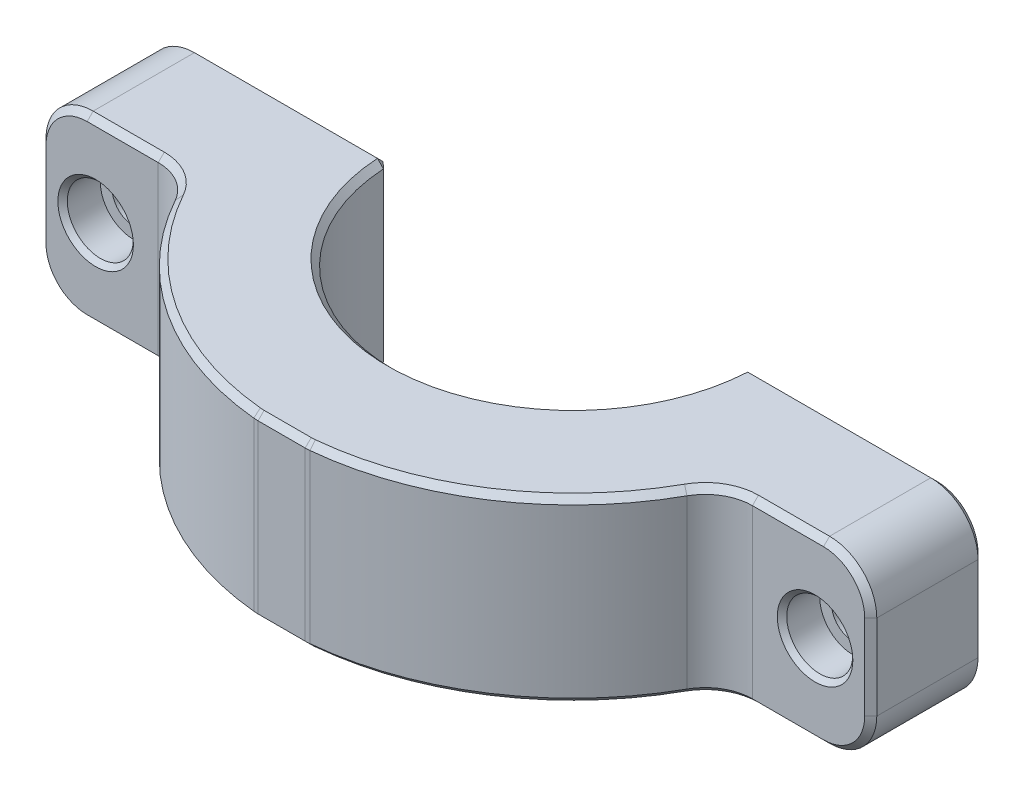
ISO-10303-21;
HEADER;
FILE_DESCRIPTION(('STEP AP214'),'2;1');
FILE_NAME('part.step','',(''),(''),'','','');
FILE_SCHEMA(('AUTOMOTIVE_DESIGN { 1 0 10303 214 1 1 1 1 }'));
ENDSEC;
DATA;
#1=APPLICATION_CONTEXT('core data for automotive mechanical design processes');
#2=APPLICATION_PROTOCOL_DEFINITION('international standard','automotive_design',2000,#1);
#3=PRODUCT_CONTEXT('',#1,'mechanical');
#4=PRODUCT('Part','Part','',(#3));
#5=PRODUCT_RELATED_PRODUCT_CATEGORY('part','',(#4));
#6=PRODUCT_DEFINITION_FORMATION('','',#4);
#7=PRODUCT_DEFINITION_CONTEXT('part definition',#1,'design');
#8=PRODUCT_DEFINITION('design','',#6,#7);
#9=PRODUCT_DEFINITION_SHAPE('','',#8);
#10=(LENGTH_UNIT() NAMED_UNIT(*) SI_UNIT(.MILLI.,.METRE.));
#11=(NAMED_UNIT(*) PLANE_ANGLE_UNIT() SI_UNIT($,.RADIAN.));
#12=(NAMED_UNIT(*) SI_UNIT($,.STERADIAN.) SOLID_ANGLE_UNIT());
#13=UNCERTAINTY_MEASURE_WITH_UNIT(LENGTH_MEASURE(1.E-05),#10,'distance_accuracy_value','');
#14=(GEOMETRIC_REPRESENTATION_CONTEXT(3) GLOBAL_UNCERTAINTY_ASSIGNED_CONTEXT((#13)) GLOBAL_UNIT_ASSIGNED_CONTEXT((#10,
#11,#12)) REPRESENTATION_CONTEXT('',''));
#15=CARTESIAN_POINT('',(0.,0.,0.));
#16=DIRECTION('',(0.,0.,1.));
#17=DIRECTION('',(1.,0.,0.));
#18=AXIS2_PLACEMENT_3D('',#15,#16,#17);
#19=CARTESIAN_POINT('',(-69.85,15.08125,-24.13));
#20=DIRECTION('',(1.,0.,0.));
#21=DIRECTION('',(0.,0.,-1.));
#22=AXIS2_PLACEMENT_3D('',#19,#20,#21);
#23=PLANE('',#22);
#24=DIRECTION('',(0.,0.,1.));
#25=VECTOR('',#24,1.);
#26=CARTESIAN_POINT('',(-69.85,7.14375,-24.13));
#27=LINE('',#26,#25);
#28=CARTESIAN_POINT('',(-69.85,7.14375,-6.09599999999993));
#29=VERTEX_POINT('',#28);
#30=CARTESIAN_POINT('',(-69.85,7.14375,-23.1139999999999));
#31=VERTEX_POINT('',#30);
#32=EDGE_CURVE('E833',#29,#31,#27,.F.);
#33=ORIENTED_EDGE('',*,*,#32,.T.);
#34=DIRECTION('',(0.,-1.,0.));
#35=VECTOR('',#34,1.);
#36=CARTESIAN_POINT('',(-69.85,15.08125,-23.1139999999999));
#37=LINE('',#36,#35);
#38=CARTESIAN_POINT('',(-69.85,-7.14375,-23.1139999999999));
#39=VERTEX_POINT('',#38);
#40=EDGE_CURVE('E709',#31,#39,#37,.T.);
#41=ORIENTED_EDGE('',*,*,#40,.T.);
#42=DIRECTION('',(0.,0.,1.));
#43=VECTOR('',#42,1.);
#44=CARTESIAN_POINT('',(-69.85,-7.14375,-24.13));
#45=LINE('',#44,#43);
#46=CARTESIAN_POINT('',(-69.85,-7.14375,-6.09599999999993));
#47=VERTEX_POINT('',#46);
#48=EDGE_CURVE('E627',#39,#47,#45,.T.);
#49=ORIENTED_EDGE('',*,*,#48,.T.);
#50=DIRECTION('',(0.,1.,0.));
#51=VECTOR('',#50,1.);
#52=CARTESIAN_POINT('',(-69.85,7.14375,-6.09599999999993));
#53=LINE('',#52,#51);
#54=EDGE_CURVE('E707',#47,#29,#53,.T.);
#55=ORIENTED_EDGE('',*,*,#54,.T.);
#56=EDGE_LOOP('',(#33,#41,#49,#55));
#57=FACE_BOUND('',#56,.T.);
#58=ADVANCED_FACE('F35',(#57),#23,.F.);
#59=CARTESIAN_POINT('',(-69.85,15.08125,24.13));
#60=DIRECTION('',(0.,0.,-1.));
#61=DIRECTION('',(-1.,0.,0.));
#62=AXIS2_PLACEMENT_3D('',#59,#60,#61);
#63=PLANE('',#62);
#64=DIRECTION('',(0.,-1.,0.));
#65=VECTOR('',#64,1.);
#66=CARTESIAN_POINT('',(-3.96099542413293,-15.08125,24.13));
#67=LINE('',#66,#65);
#68=CARTESIAN_POINT('',(-3.96099542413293,14.0652500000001,24.13));
#69=VERTEX_POINT('',#68);
#70=CARTESIAN_POINT('',(-3.96099542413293,-14.0652500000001,24.13));
#71=VERTEX_POINT('',#70);
#72=EDGE_CURVE('E804',#69,#71,#67,.T.);
#73=ORIENTED_EDGE('',*,*,#72,.T.);
#74=DIRECTION('',(1.,0.,0.));
#75=VECTOR('',#74,1.);
#76=CARTESIAN_POINT('',(-69.85,-14.0652500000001,24.13));
#77=LINE('',#76,#75);
#78=CARTESIAN_POINT('',(3.96099542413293,-14.0652500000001,24.13));
#79=VERTEX_POINT('',#78);
#80=EDGE_CURVE('E762',#71,#79,#77,.T.);
#81=ORIENTED_EDGE('',*,*,#80,.T.);
#82=DIRECTION('',(0.,-1.,0.));
#83=VECTOR('',#82,1.);
#84=CARTESIAN_POINT('',(3.96099542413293,15.08125,24.13));
#85=LINE('',#84,#83);
#86=CARTESIAN_POINT('',(3.96099542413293,14.0652500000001,24.13));
#87=VERTEX_POINT('',#86);
#88=EDGE_CURVE('E802',#79,#87,#85,.F.);
#89=ORIENTED_EDGE('',*,*,#88,.T.);
#90=DIRECTION('',(-1.,0.,0.));
#91=VECTOR('',#90,1.);
#92=CARTESIAN_POINT('',(-3.96099542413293,14.0652500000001,24.13));
#93=LINE('',#92,#91);
#94=EDGE_CURVE('E760',#87,#69,#93,.T.);
#95=ORIENTED_EDGE('',*,*,#94,.T.);
#96=EDGE_LOOP('',(#73,#81,#89,#95));
#97=FACE_BOUND('',#96,.T.);
#98=ADVANCED_FACE('F565',(#97),#63,.F.);
#99=CARTESIAN_POINT('',(0.,15.08125,0.));
#100=DIRECTION('',(0.,1.,0.));
#101=DIRECTION('',(0.,0.,1.));
#102=AXIS2_PLACEMENT_3D('',#99,#100,#101);
#103=PLANE('',#102);
#104=CARTESIAN_POINT('',(0.,15.08125,-24.892));
#105=DIRECTION('',(0.,1.,0.));
#106=DIRECTION('',(0.,0.,1.));
#107=AXIS2_PLACEMENT_3D('',#104,#105,#106);
#108=CIRCLE('',#107,31.1785000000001);
#109=CARTESIAN_POINT('',(31.1277621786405,15.08125,-23.1139999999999));
#110=VERTEX_POINT('',#109);
#111=CARTESIAN_POINT('',(-31.1277621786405,15.08125,-23.1139999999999));
#112=VERTEX_POINT('',#111);
#113=EDGE_CURVE('E741',#110,#112,#108,.F.);
#114=ORIENTED_EDGE('',*,*,#113,.T.);
#115=DIRECTION('',(-1.,0.,0.));
#116=VECTOR('',#115,1.);
#117=CARTESIAN_POINT('',(-61.9125,15.08125,-23.1139999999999));
#118=LINE('',#117,#116);
#119=CARTESIAN_POINT('',(-61.9125,15.08125,-23.1139999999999));
#120=VERTEX_POINT('',#119);
#121=EDGE_CURVE('E745',#112,#120,#118,.T.);
#122=ORIENTED_EDGE('',*,*,#121,.T.);
#123=DIRECTION('',(0.,0.,1.));
#124=VECTOR('',#123,1.);
#125=CARTESIAN_POINT('',(-61.9125,15.08125,-5.08));
#126=LINE('',#125,#124);
#127=CARTESIAN_POINT('',(-61.9125,15.08125,-6.09599999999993));
#128=VERTEX_POINT('',#127);
#129=EDGE_CURVE('E820',#120,#128,#126,.T.);
#130=ORIENTED_EDGE('',*,*,#129,.T.);
#131=DIRECTION('',(1.,0.,0.));
#132=VECTOR('',#131,1.);
#133=CARTESIAN_POINT('',(0.,15.08125,-6.09599999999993));
#134=LINE('',#133,#132);
#135=CARTESIAN_POINT('',(-49.9608621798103,15.08125,-6.09599999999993));
#136=VERTEX_POINT('',#135);
#137=EDGE_CURVE('E731',#128,#136,#134,.T.);
#138=ORIENTED_EDGE('',*,*,#137,.T.);
#139=CARTESIAN_POINT('',(-49.9608621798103,15.08125,2.85749999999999));
#140=DIRECTION('',(0.,1.,0.));
#141=DIRECTION('',(0.,0.,1.));
#142=AXIS2_PLACEMENT_3D('',#139,#140,#141);
#143=CIRCLE('',#142,8.95349999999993);
#144=CARTESIAN_POINT('',(-42.1336604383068,15.08125,-1.48992166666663));
#145=VERTEX_POINT('',#144);
#146=EDGE_CURVE('E727',#136,#145,#143,.F.);
#147=ORIENTED_EDGE('',*,*,#146,.T.);
#148=CARTESIAN_POINT('',(0.,15.08125,-24.892));
#149=DIRECTION('',(0.,1.,0.));
#150=DIRECTION('',(0.,0.,1.));
#151=AXIS2_PLACEMENT_3D('',#148,#149,#150);
#152=CIRCLE('',#151,48.1965000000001);
#153=CARTESIAN_POINT('',(-4.62522388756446,15.08125,23.0820546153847));
#154=VERTEX_POINT('',#153);
#155=EDGE_CURVE('E637',#145,#154,#152,.T.);
#156=ORIENTED_EDGE('',*,*,#155,.T.);
#157=CARTESIAN_POINT('',(-3.96099542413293,15.08125,16.1925));
#158=DIRECTION('',(0.,1.,0.));
#159=DIRECTION('',(0.,0.,1.));
#160=AXIS2_PLACEMENT_3D('',#157,#158,#159);
#161=CIRCLE('',#160,6.92150000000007);
#162=CARTESIAN_POINT('',(-3.96099542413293,15.08125,23.1140000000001));
#163=VERTEX_POINT('',#162);
#164=EDGE_CURVE('E725',#154,#163,#161,.T.);
#165=ORIENTED_EDGE('',*,*,#164,.T.);
#166=DIRECTION('',(1.,0.,0.));
#167=VECTOR('',#166,1.);
#168=CARTESIAN_POINT('',(3.96099542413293,15.08125,23.1140000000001));
#169=LINE('',#168,#167);
#170=CARTESIAN_POINT('',(3.96099542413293,15.08125,23.1140000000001));
#171=VERTEX_POINT('',#170);
#172=EDGE_CURVE('E729',#163,#171,#169,.T.);
#173=ORIENTED_EDGE('',*,*,#172,.T.);
#174=CARTESIAN_POINT('',(3.96099542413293,15.08125,16.1925));
#175=DIRECTION('',(0.,1.,0.));
#176=DIRECTION('',(0.,0.,1.));
#177=AXIS2_PLACEMENT_3D('',#174,#175,#176);
#178=CIRCLE('',#177,6.92150000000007);
#179=CARTESIAN_POINT('',(4.62522388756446,15.08125,23.0820546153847));
#180=VERTEX_POINT('',#179);
#181=EDGE_CURVE('E733',#171,#180,#178,.T.);
#182=ORIENTED_EDGE('',*,*,#181,.T.);
#183=CARTESIAN_POINT('',(0.,15.08125,-24.892));
#184=DIRECTION('',(0.,1.,0.));
#185=DIRECTION('',(0.,0.,1.));
#186=AXIS2_PLACEMENT_3D('',#183,#184,#185);
#187=CIRCLE('',#186,48.1965000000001);
#188=CARTESIAN_POINT('',(42.1336604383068,15.08125,-1.48992166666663));
#189=VERTEX_POINT('',#188);
#190=EDGE_CURVE('E735',#180,#189,#187,.T.);
#191=ORIENTED_EDGE('',*,*,#190,.T.);
#192=CARTESIAN_POINT('',(49.9608621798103,15.08125,2.85749999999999));
#193=DIRECTION('',(0.,1.,0.));
#194=DIRECTION('',(0.,0.,1.));
#195=AXIS2_PLACEMENT_3D('',#192,#193,#194);
#196=CIRCLE('',#195,8.95349999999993);
#197=CARTESIAN_POINT('',(49.9608621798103,15.08125,-6.09599999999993));
#198=VERTEX_POINT('',#197);
#199=EDGE_CURVE('E737',#189,#198,#196,.F.);
#200=ORIENTED_EDGE('',*,*,#199,.T.);
#201=DIRECTION('',(1.,0.,0.));
#202=VECTOR('',#201,1.);
#203=CARTESIAN_POINT('',(0.,15.08125,-6.09599999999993));
#204=LINE('',#203,#202);
#205=CARTESIAN_POINT('',(61.9125,15.08125,-6.09599999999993));
#206=VERTEX_POINT('',#205);
#207=EDGE_CURVE('E739',#198,#206,#204,.T.);
#208=ORIENTED_EDGE('',*,*,#207,.T.);
#209=DIRECTION('',(0.,0.,-1.));
#210=VECTOR('',#209,1.);
#211=CARTESIAN_POINT('',(61.9125,15.08125,-24.13));
#212=LINE('',#211,#210);
#213=CARTESIAN_POINT('',(61.9125,15.08125,-23.1139999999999));
#214=VERTEX_POINT('',#213);
#215=EDGE_CURVE('E789',#206,#214,#212,.T.);
#216=ORIENTED_EDGE('',*,*,#215,.T.);
#217=DIRECTION('',(-1.,0.,0.));
#218=VECTOR('',#217,1.);
#219=CARTESIAN_POINT('',(30.1528732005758,15.08125,-23.1139999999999));
#220=LINE('',#219,#218);
#221=EDGE_CURVE('E743',#214,#110,#220,.T.);
#222=ORIENTED_EDGE('',*,*,#221,.T.);
#223=EDGE_LOOP('',(#114,#122,#130,#138,#147,#156,#165,#173,#182,#191,#200,#208,#216,#222));
#224=FACE_BOUND('',#223,.T.);
#225=ADVANCED_FACE('F571',(#224),#103,.T.);
#226=CARTESIAN_POINT('',(0.,-15.08125,0.));
#227=DIRECTION('',(0.,1.,0.));
#228=DIRECTION('',(0.,0.,1.));
#229=AXIS2_PLACEMENT_3D('',#226,#227,#228);
#230=PLANE('',#229);
#231=DIRECTION('',(0.,0.,1.));
#232=VECTOR('',#231,1.);
#233=CARTESIAN_POINT('',(-61.9125,-15.08125,0.));
#234=LINE('',#233,#232);
#235=CARTESIAN_POINT('',(-61.9125,-15.08125,-6.09599999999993));
#236=VERTEX_POINT('',#235);
#237=CARTESIAN_POINT('',(-61.9125,-15.08125,-23.1139999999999));
#238=VERTEX_POINT('',#237);
#239=EDGE_CURVE('E282',#236,#238,#234,.F.);
#240=ORIENTED_EDGE('',*,*,#239,.T.);
#241=DIRECTION('',(1.,0.,0.));
#242=VECTOR('',#241,1.);
#243=CARTESIAN_POINT('',(0.,-15.08125,-23.1139999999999));
#244=LINE('',#243,#242);
#245=CARTESIAN_POINT('',(-31.1277621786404,-15.08125,-23.1139999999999));
#246=VERTEX_POINT('',#245);
#247=EDGE_CURVE('E857',#238,#246,#244,.T.);
#248=ORIENTED_EDGE('',*,*,#247,.T.);
#249=CARTESIAN_POINT('',(0.,-15.08125,-24.892));
#250=DIRECTION('',(0.,1.,0.));
#251=DIRECTION('',(0.,0.,1.));
#252=AXIS2_PLACEMENT_3D('',#249,#250,#251);
#253=CIRCLE('',#252,31.1785);
#254=CARTESIAN_POINT('',(31.1277621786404,-15.08125,-23.1139999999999));
#255=VERTEX_POINT('',#254);
#256=EDGE_CURVE('E854',#246,#255,#253,.T.);
#257=ORIENTED_EDGE('',*,*,#256,.T.);
#258=DIRECTION('',(1.,0.,0.));
#259=VECTOR('',#258,1.);
#260=CARTESIAN_POINT('',(0.,-15.08125,-23.1139999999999));
#261=LINE('',#260,#259);
#262=CARTESIAN_POINT('',(61.9125,-15.08125,-23.1139999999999));
#263=VERTEX_POINT('',#262);
#264=EDGE_CURVE('E852',#255,#263,#261,.T.);
#265=ORIENTED_EDGE('',*,*,#264,.T.);
#266=DIRECTION('',(0.,0.,-1.));
#267=VECTOR('',#266,1.);
#268=CARTESIAN_POINT('',(61.9125,-15.08125,0.));
#269=LINE('',#268,#267);
#270=CARTESIAN_POINT('',(61.9125,-15.08125,-6.09599999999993));
#271=VERTEX_POINT('',#270);
#272=EDGE_CURVE('E301',#263,#271,#269,.F.);
#273=ORIENTED_EDGE('',*,*,#272,.T.);
#274=DIRECTION('',(-1.,0.,0.));
#275=VECTOR('',#274,1.);
#276=CARTESIAN_POINT('',(49.9608621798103,-15.08125,-6.09599999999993));
#277=LINE('',#276,#275);
#278=CARTESIAN_POINT('',(49.9608621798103,-15.08125,-6.09599999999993));
#279=VERTEX_POINT('',#278);
#280=EDGE_CURVE('E850',#271,#279,#277,.T.);
#281=ORIENTED_EDGE('',*,*,#280,.T.);
#282=CARTESIAN_POINT('',(49.9608621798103,-15.08125,2.85749999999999));
#283=DIRECTION('',(0.,1.,0.));
#284=DIRECTION('',(0.,0.,1.));
#285=AXIS2_PLACEMENT_3D('',#282,#283,#284);
#286=CIRCLE('',#285,8.95349999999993);
#287=CARTESIAN_POINT('',(42.1336604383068,-15.08125,-1.48992166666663));
#288=VERTEX_POINT('',#287);
#289=EDGE_CURVE('E848',#279,#288,#286,.T.);
#290=ORIENTED_EDGE('',*,*,#289,.T.);
#291=CARTESIAN_POINT('',(0.,-15.08125,-24.892));
#292=DIRECTION('',(0.,1.,0.));
#293=DIRECTION('',(0.,0.,1.));
#294=AXIS2_PLACEMENT_3D('',#291,#292,#293);
#295=CIRCLE('',#294,48.1965000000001);
#296=CARTESIAN_POINT('',(4.62522388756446,-15.08125,23.0820546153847));
#297=VERTEX_POINT('',#296);
#298=EDGE_CURVE('E845',#288,#297,#295,.F.);
#299=ORIENTED_EDGE('',*,*,#298,.T.);
#300=CARTESIAN_POINT('',(3.96099542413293,-15.08125,16.1925));
#301=DIRECTION('',(0.,1.,0.));
#302=DIRECTION('',(0.,0.,1.));
#303=AXIS2_PLACEMENT_3D('',#300,#301,#302);
#304=CIRCLE('',#303,6.92150000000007);
#305=CARTESIAN_POINT('',(3.96099542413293,-15.08125,23.1140000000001));
#306=VERTEX_POINT('',#305);
#307=EDGE_CURVE('E843',#297,#306,#304,.F.);
#308=ORIENTED_EDGE('',*,*,#307,.T.);
#309=DIRECTION('',(-1.,0.,0.));
#310=VECTOR('',#309,1.);
#311=CARTESIAN_POINT('',(0.,-15.08125,23.1140000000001));
#312=LINE('',#311,#310);
#313=CARTESIAN_POINT('',(-3.96099542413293,-15.08125,23.1140000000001));
#314=VERTEX_POINT('',#313);
#315=EDGE_CURVE('E841',#306,#314,#312,.T.);
#316=ORIENTED_EDGE('',*,*,#315,.T.);
#317=CARTESIAN_POINT('',(-3.96099542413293,-15.08125,16.1925));
#318=DIRECTION('',(0.,1.,0.));
#319=DIRECTION('',(0.,0.,1.));
#320=AXIS2_PLACEMENT_3D('',#317,#318,#319);
#321=CIRCLE('',#320,6.92150000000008);
#322=CARTESIAN_POINT('',(-4.62522388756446,-15.08125,23.0820546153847));
#323=VERTEX_POINT('',#322);
#324=EDGE_CURVE('E796',#314,#323,#321,.F.);
#325=ORIENTED_EDGE('',*,*,#324,.T.);
#326=CARTESIAN_POINT('',(0.,-15.08125,-24.892));
#327=DIRECTION('',(0.,1.,0.));
#328=DIRECTION('',(0.,0.,1.));
#329=AXIS2_PLACEMENT_3D('',#326,#327,#328);
#330=CIRCLE('',#329,48.1965000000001);
#331=CARTESIAN_POINT('',(-42.1336604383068,-15.08125,-1.48992166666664));
#332=VERTEX_POINT('',#331);
#333=EDGE_CURVE('E792',#323,#332,#330,.F.);
#334=ORIENTED_EDGE('',*,*,#333,.T.);
#335=CARTESIAN_POINT('',(-49.9608621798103,-15.08125,2.85749999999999));
#336=DIRECTION('',(0.,1.,0.));
#337=DIRECTION('',(0.,0.,1.));
#338=AXIS2_PLACEMENT_3D('',#335,#336,#337);
#339=CIRCLE('',#338,8.95349999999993);
#340=CARTESIAN_POINT('',(-49.9608621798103,-15.08125,-6.09599999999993));
#341=VERTEX_POINT('',#340);
#342=EDGE_CURVE('E285',#332,#341,#339,.T.);
#343=ORIENTED_EDGE('',*,*,#342,.T.);
#344=DIRECTION('',(-1.,0.,0.));
#345=VECTOR('',#344,1.);
#346=CARTESIAN_POINT('',(-61.9125,-15.08125,-6.09599999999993));
#347=LINE('',#346,#345);
#348=EDGE_CURVE('E279',#341,#236,#347,.T.);
#349=ORIENTED_EDGE('',*,*,#348,.T.);
#350=EDGE_LOOP('',(#240,#248,#257,#265,#273,#281,#290,#299,#308,#316,#325,#334,#343,#349));
#351=FACE_BOUND('',#350,.T.);
#352=ADVANCED_FACE('F281',(#351),#230,.F.);
#353=CARTESIAN_POINT('',(-69.85,15.08125,-24.13));
#354=DIRECTION('',(0.,0.,1.));
#355=DIRECTION('',(1.,0.,0.));
#356=AXIS2_PLACEMENT_3D('',#353,#354,#355);
#357=PLANE('',#356);
#358=DIRECTION('',(-1.,0.,0.));
#359=VECTOR('',#358,1.);
#360=CARTESIAN_POINT('',(-69.85,-14.0652499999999,-24.13));
#361=LINE('',#360,#359);
#362=CARTESIAN_POINT('',(61.9125,-14.0652499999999,-24.13));
#363=VERTEX_POINT('',#362);
#364=CARTESIAN_POINT('',(31.1955472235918,-14.0652499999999,-24.13));
#365=VERTEX_POINT('',#364);
#366=EDGE_CURVE('E875',#363,#365,#361,.T.);
#367=ORIENTED_EDGE('',*,*,#366,.T.);
#368=DIRECTION('',(0.,1.,0.));
#369=VECTOR('',#368,1.);
#370=CARTESIAN_POINT('',(31.1955472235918,15.08125,-24.13));
#371=LINE('',#370,#369);
#372=CARTESIAN_POINT('',(31.1955472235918,14.0652499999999,-24.13));
#373=VERTEX_POINT('',#372);
#374=EDGE_CURVE('E877',#365,#373,#371,.T.);
#375=ORIENTED_EDGE('',*,*,#374,.T.);
#376=DIRECTION('',(1.,0.,0.));
#377=VECTOR('',#376,1.);
#378=CARTESIAN_POINT('',(61.9125,14.0652499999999,-24.13));
#379=LINE('',#378,#377);
#380=CARTESIAN_POINT('',(61.9125,14.0652499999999,-24.13));
#381=VERTEX_POINT('',#380);
#382=EDGE_CURVE('E868',#373,#381,#379,.T.);
#383=ORIENTED_EDGE('',*,*,#382,.T.);
#384=CARTESIAN_POINT('',(61.9125,7.14375,-24.13));
#385=DIRECTION('',(0.,0.,1.));
#386=DIRECTION('',(1.,0.,0.));
#387=AXIS2_PLACEMENT_3D('',#384,#385,#386);
#388=CIRCLE('',#387,6.92149999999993);
#389=CARTESIAN_POINT('',(68.8339999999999,7.14375,-24.13));
#390=VERTEX_POINT('',#389);
#391=EDGE_CURVE('E870',#381,#390,#388,.F.);
#392=ORIENTED_EDGE('',*,*,#391,.T.);
#393=DIRECTION('',(0.,-1.,0.));
#394=VECTOR('',#393,1.);
#395=CARTESIAN_POINT('',(68.8339999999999,15.08125,-24.13));
#396=LINE('',#395,#394);
#397=CARTESIAN_POINT('',(68.8339999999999,-7.14375,-24.13));
#398=VERTEX_POINT('',#397);
#399=EDGE_CURVE('E642',#390,#398,#396,.T.);
#400=ORIENTED_EDGE('',*,*,#399,.T.);
#401=CARTESIAN_POINT('',(61.9125,-7.14375,-24.13));
#402=DIRECTION('',(0.,0.,1.));
#403=DIRECTION('',(1.,0.,0.));
#404=AXIS2_PLACEMENT_3D('',#401,#402,#403);
#405=CIRCLE('',#404,6.92149999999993);
#406=EDGE_CURVE('E873',#398,#363,#405,.F.);
#407=ORIENTED_EDGE('',*,*,#406,.T.);
#408=EDGE_LOOP('',(#367,#375,#383,#392,#400,#407));
#409=FACE_BOUND('',#408,.T.);
#410=CARTESIAN_POINT('',(60.487444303,0.,-24.13));
#411=DIRECTION('',(0.,0.,1.));
#412=DIRECTION('',(1.,0.,0.));
#413=AXIS2_PLACEMENT_3D('',#410,#411,#412);
#414=CIRCLE('',#413,3.57124);
#415=CARTESIAN_POINT('',(64.058684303,0.,-24.13));
#416=VERTEX_POINT('',#415);
#417=EDGE_CURVE('E1010',#416,#416,#414,.T.);
#418=ORIENTED_EDGE('',*,*,#417,.T.);
#419=EDGE_LOOP('',(#418));
#420=FACE_BOUND('',#419,.T.);
#421=ADVANCED_FACE('F583',(#409,#420),#357,.F.);
#422=CARTESIAN_POINT('',(69.85,15.08125,-24.13));
#423=DIRECTION('',(-1.,0.,0.));
#424=DIRECTION('',(0.,0.,1.));
#425=AXIS2_PLACEMENT_3D('',#422,#423,#424);
#426=PLANE('',#425);
#427=DIRECTION('',(0.,0.,-1.));
#428=VECTOR('',#427,1.);
#429=CARTESIAN_POINT('',(69.85,-7.14375,-24.13));
#430=LINE('',#429,#428);
#431=CARTESIAN_POINT('',(69.85,-7.14375,-6.09599999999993));
#432=VERTEX_POINT('',#431);
#433=CARTESIAN_POINT('',(69.85,-7.14375,-23.1139999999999));
#434=VERTEX_POINT('',#433);
#435=EDGE_CURVE('E290',#432,#434,#430,.T.);
#436=ORIENTED_EDGE('',*,*,#435,.T.);
#437=DIRECTION('',(0.,1.,0.));
#438=VECTOR('',#437,1.);
#439=CARTESIAN_POINT('',(69.85,15.08125,-23.1139999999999));
#440=LINE('',#439,#438);
#441=CARTESIAN_POINT('',(69.85,7.14375,-23.1139999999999));
#442=VERTEX_POINT('',#441);
#443=EDGE_CURVE('E641',#434,#442,#440,.T.);
#444=ORIENTED_EDGE('',*,*,#443,.T.);
#445=DIRECTION('',(0.,0.,-1.));
#446=VECTOR('',#445,1.);
#447=CARTESIAN_POINT('',(69.85,7.14375,-5.08));
#448=LINE('',#447,#446);
#449=CARTESIAN_POINT('',(69.85,7.14375,-6.09599999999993));
#450=VERTEX_POINT('',#449);
#451=EDGE_CURVE('E619',#442,#450,#448,.F.);
#452=ORIENTED_EDGE('',*,*,#451,.T.);
#453=DIRECTION('',(0.,-1.,0.));
#454=VECTOR('',#453,1.);
#455=CARTESIAN_POINT('',(69.85,-7.14375,-6.09599999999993));
#456=LINE('',#455,#454);
#457=EDGE_CURVE('E712',#450,#432,#456,.T.);
#458=ORIENTED_EDGE('',*,*,#457,.T.);
#459=EDGE_LOOP('',(#436,#444,#452,#458));
#460=FACE_BOUND('',#459,.T.);
#461=ADVANCED_FACE('F581',(#460),#426,.F.);
#462=DIRECTION('',(1.,0.,0.));
#463=VECTOR('',#462,1.);
#464=CARTESIAN_POINT('',(-30.1528732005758,14.0652499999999,-24.13));
#465=LINE('',#464,#463);
#466=CARTESIAN_POINT('',(-61.9125,14.0652499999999,-24.13));
#467=VERTEX_POINT('',#466);
#468=CARTESIAN_POINT('',(-31.1955472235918,14.0652499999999,-24.13));
#469=VERTEX_POINT('',#468);
#470=EDGE_CURVE('E880',#467,#469,#465,.T.);
#471=ORIENTED_EDGE('',*,*,#470,.T.);
#472=DIRECTION('',(0.,-1.,0.));
#473=VECTOR('',#472,1.);
#474=CARTESIAN_POINT('',(-31.1955472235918,15.08125,-24.13));
#475=LINE('',#474,#473);
#476=CARTESIAN_POINT('',(-31.1955472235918,-14.0652499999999,-24.13));
#477=VERTEX_POINT('',#476);
#478=EDGE_CURVE('E309',#469,#477,#475,.T.);
#479=ORIENTED_EDGE('',*,*,#478,.T.);
#480=DIRECTION('',(-1.,0.,0.));
#481=VECTOR('',#480,1.);
#482=CARTESIAN_POINT('',(-69.85,-14.0652499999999,-24.13));
#483=LINE('',#482,#481);
#484=CARTESIAN_POINT('',(-61.9125,-14.0652499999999,-24.13));
#485=VERTEX_POINT('',#484);
#486=EDGE_CURVE('E888',#477,#485,#483,.T.);
#487=ORIENTED_EDGE('',*,*,#486,.T.);
#488=CARTESIAN_POINT('',(-61.9125,-7.14375,-24.13));
#489=DIRECTION('',(0.,0.,1.));
#490=DIRECTION('',(1.,0.,0.));
#491=AXIS2_PLACEMENT_3D('',#488,#489,#490);
#492=CIRCLE('',#491,6.92149999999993);
#493=CARTESIAN_POINT('',(-68.8339999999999,-7.14375,-24.13));
#494=VERTEX_POINT('',#493);
#495=EDGE_CURVE('E886',#485,#494,#492,.F.);
#496=ORIENTED_EDGE('',*,*,#495,.T.);
#497=DIRECTION('',(0.,1.,0.));
#498=VECTOR('',#497,1.);
#499=CARTESIAN_POINT('',(-68.8339999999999,15.08125,-24.13));
#500=LINE('',#499,#498);
#501=CARTESIAN_POINT('',(-68.8339999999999,7.14375,-24.13));
#502=VERTEX_POINT('',#501);
#503=EDGE_CURVE('E884',#494,#502,#500,.T.);
#504=ORIENTED_EDGE('',*,*,#503,.T.);
#505=CARTESIAN_POINT('',(-61.9125,7.14375,-24.13));
#506=DIRECTION('',(0.,0.,1.));
#507=DIRECTION('',(1.,0.,0.));
#508=AXIS2_PLACEMENT_3D('',#505,#506,#507);
#509=CIRCLE('',#508,6.92149999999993);
#510=EDGE_CURVE('E882',#502,#467,#509,.F.);
#511=ORIENTED_EDGE('',*,*,#510,.T.);
#512=EDGE_LOOP('',(#471,#479,#487,#496,#504,#511));
#513=FACE_BOUND('',#512,.T.);
#514=CARTESIAN_POINT('',(-60.487444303,0.,-24.13));
#515=DIRECTION('',(0.,0.,1.));
#516=DIRECTION('',(1.,0.,0.));
#517=AXIS2_PLACEMENT_3D('',#514,#515,#516);
#518=CIRCLE('',#517,3.57124);
#519=CARTESIAN_POINT('',(-56.916204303,0.,-24.13));
#520=VERTEX_POINT('',#519);
#521=EDGE_CURVE('E808',#520,#520,#518,.T.);
#522=ORIENTED_EDGE('',*,*,#521,.T.);
#523=EDGE_LOOP('',(#522));
#524=FACE_BOUND('',#523,.T.);
#525=ADVANCED_FACE('F577',(#513,#524),#357,.F.);
#526=CARTESIAN_POINT('',(0.,-15.08125,-24.892));
#527=DIRECTION('',(0.,1.,0.));
#528=DIRECTION('',(0.,0.,1.));
#529=AXIS2_PLACEMENT_3D('',#526,#527,#528);
#530=CYLINDRICAL_SURFACE('',#529,30.1625);
#531=DIRECTION('',(0.,1.,0.));
#532=VECTOR('',#531,1.);
#533=CARTESIAN_POINT('',(30.1090450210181,-15.08125,-23.0970587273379));
#534=LINE('',#533,#532);
#535=CARTESIAN_POINT('',(30.1090450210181,14.0652499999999,-23.0970587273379));
#536=VERTEX_POINT('',#535);
#537=CARTESIAN_POINT('',(30.1090450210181,-14.0652500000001,-23.0970587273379));
#538=VERTEX_POINT('',#537);
#539=EDGE_CURVE('E863',#536,#538,#534,.F.);
#540=ORIENTED_EDGE('',*,*,#539,.T.);
#541=CARTESIAN_POINT('',(0.,-14.0652500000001,-24.892));
#542=DIRECTION('',(0.,1.,0.));
#543=DIRECTION('',(0.,0.,1.));
#544=AXIS2_PLACEMENT_3D('',#541,#542,#543);
#545=CIRCLE('',#544,30.1625);
#546=CARTESIAN_POINT('',(-30.1090450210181,-14.0652500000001,-23.0970587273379));
#547=VERTEX_POINT('',#546);
#548=EDGE_CURVE('E865',#538,#547,#545,.F.);
#549=ORIENTED_EDGE('',*,*,#548,.T.);
#550=DIRECTION('',(0.,1.,0.));
#551=VECTOR('',#550,1.);
#552=CARTESIAN_POINT('',(-30.1090450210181,-15.08125,-23.0970587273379));
#553=LINE('',#552,#551);
#554=CARTESIAN_POINT('',(-30.1090450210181,14.0652499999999,-23.0970587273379));
#555=VERTEX_POINT('',#554);
#556=EDGE_CURVE('E861',#547,#555,#553,.T.);
#557=ORIENTED_EDGE('',*,*,#556,.T.);
#558=CARTESIAN_POINT('',(0.,14.0652499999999,-24.892));
#559=DIRECTION('',(0.,1.,0.));
#560=DIRECTION('',(0.,0.,1.));
#561=AXIS2_PLACEMENT_3D('',#558,#559,#560);
#562=CIRCLE('',#561,30.1625);
#563=EDGE_CURVE('E859',#555,#536,#562,.T.);
#564=ORIENTED_EDGE('',*,*,#563,.T.);
#565=EDGE_LOOP('',(#540,#549,#557,#564));
#566=FACE_BOUND('',#565,.T.);
#567=ADVANCED_FACE('F580',(#566),#530,.F.);
#568=CARTESIAN_POINT('',(-69.85,15.08125,-5.08));
#569=DIRECTION('',(0.,0.,1.));
#570=DIRECTION('',(1.,0.,0.));
#571=AXIS2_PLACEMENT_3D('',#568,#569,#570);
#572=PLANE('',#571);
#573=CARTESIAN_POINT('',(60.487444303,0.,-5.08));
#574=DIRECTION('',(0.,0.,1.));
#575=DIRECTION('',(1.,0.,0.));
#576=AXIS2_PLACEMENT_3D('',#573,#574,#575);
#577=CIRCLE('',#576,6.35);
#578=CARTESIAN_POINT('',(66.837444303,0.,-5.08));
#579=VERTEX_POINT('',#578);
#580=EDGE_CURVE('E650',#579,#579,#577,.T.);
#581=ORIENTED_EDGE('',*,*,#580,.F.);
#582=EDGE_LOOP('',(#581));
#583=FACE_BOUND('',#582,.T.);
#584=DIRECTION('',(0.,-1.,0.));
#585=VECTOR('',#584,1.);
#586=CARTESIAN_POINT('',(49.9608621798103,-15.08125,-5.08));
#587=LINE('',#586,#585);
#588=CARTESIAN_POINT('',(49.9608621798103,14.0652500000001,-5.08));
#589=VERTEX_POINT('',#588);
#590=CARTESIAN_POINT('',(49.9608621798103,-14.0652500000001,-5.08));
#591=VERTEX_POINT('',#590);
#592=EDGE_CURVE('E828',#589,#591,#587,.T.);
#593=ORIENTED_EDGE('',*,*,#592,.T.);
#594=DIRECTION('',(1.,0.,0.));
#595=VECTOR('',#594,1.);
#596=CARTESIAN_POINT('',(61.9125,-14.0652500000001,-5.08));
#597=LINE('',#596,#595);
#598=CARTESIAN_POINT('',(61.9125,-14.0652500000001,-5.08));
#599=VERTEX_POINT('',#598);
#600=EDGE_CURVE('E772',#591,#599,#597,.T.);
#601=ORIENTED_EDGE('',*,*,#600,.T.);
#602=CARTESIAN_POINT('',(61.9125,-7.14375,-5.08));
#603=DIRECTION('',(0.,0.,1.));
#604=DIRECTION('',(1.,0.,0.));
#605=AXIS2_PLACEMENT_3D('',#602,#603,#604);
#606=CIRCLE('',#605,6.92150000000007);
#607=CARTESIAN_POINT('',(68.8340000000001,-7.14375,-5.08));
#608=VERTEX_POINT('',#607);
#609=EDGE_CURVE('E770',#599,#608,#606,.T.);
#610=ORIENTED_EDGE('',*,*,#609,.T.);
#611=DIRECTION('',(0.,1.,0.));
#612=VECTOR('',#611,1.);
#613=CARTESIAN_POINT('',(68.8340000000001,7.14375,-5.08));
#614=LINE('',#613,#612);
#615=CARTESIAN_POINT('',(68.8340000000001,7.14375,-5.08));
#616=VERTEX_POINT('',#615);
#617=EDGE_CURVE('E768',#608,#616,#614,.T.);
#618=ORIENTED_EDGE('',*,*,#617,.T.);
#619=CARTESIAN_POINT('',(61.9125,7.14375,-5.08));
#620=DIRECTION('',(0.,0.,1.));
#621=DIRECTION('',(1.,0.,0.));
#622=AXIS2_PLACEMENT_3D('',#619,#620,#621);
#623=CIRCLE('',#622,6.92150000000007);
#624=CARTESIAN_POINT('',(61.9125,14.0652500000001,-5.08));
#625=VERTEX_POINT('',#624);
#626=EDGE_CURVE('E766',#616,#625,#623,.T.);
#627=ORIENTED_EDGE('',*,*,#626,.T.);
#628=DIRECTION('',(-1.,0.,0.));
#629=VECTOR('',#628,1.);
#630=CARTESIAN_POINT('',(-69.85,14.0652500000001,-5.08));
#631=LINE('',#630,#629);
#632=EDGE_CURVE('E764',#625,#589,#631,.T.);
#633=ORIENTED_EDGE('',*,*,#632,.T.);
#634=EDGE_LOOP('',(#593,#601,#610,#618,#627,#633));
#635=FACE_BOUND('',#634,.T.);
#636=ADVANCED_FACE('F987',(#583,#635),#572,.T.);
#637=CARTESIAN_POINT('',(0.,-15.08125,-24.892));
#638=DIRECTION('',(0.,1.,0.));
#639=DIRECTION('',(0.,0.,1.));
#640=AXIS2_PLACEMENT_3D('',#637,#638,#639);
#641=CYLINDRICAL_SURFACE('',#640,49.2125);
#642=DIRECTION('',(0.,1.,0.));
#643=VECTOR('',#642,1.);
#644=CARTESIAN_POINT('',(4.72272531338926,-15.08125,24.0933653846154));
#645=LINE('',#644,#643);
#646=CARTESIAN_POINT('',(4.72272531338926,14.0652500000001,24.0933653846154));
#647=VERTEX_POINT('',#646);
#648=CARTESIAN_POINT('',(4.72272531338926,-14.0652500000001,24.0933653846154));
#649=VERTEX_POINT('',#648);
#650=EDGE_CURVE('E826',#647,#649,#645,.F.);
#651=ORIENTED_EDGE('',*,*,#650,.T.);
#652=CARTESIAN_POINT('',(0.,-14.0652500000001,-24.892));
#653=DIRECTION('',(0.,1.,0.));
#654=DIRECTION('',(0.,0.,1.));
#655=AXIS2_PLACEMENT_3D('',#652,#653,#654);
#656=CIRCLE('',#655,49.2125);
#657=CARTESIAN_POINT('',(43.0218535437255,-14.0652500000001,-0.996597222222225));
#658=VERTEX_POINT('',#657);
#659=EDGE_CURVE('E749',#649,#658,#656,.T.);
#660=ORIENTED_EDGE('',*,*,#659,.T.);
#661=DIRECTION('',(0.,1.,0.));
#662=VECTOR('',#661,1.);
#663=CARTESIAN_POINT('',(43.0218535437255,-15.08125,-0.996597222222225));
#664=LINE('',#663,#662);
#665=CARTESIAN_POINT('',(43.0218535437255,14.0652500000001,-0.996597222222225));
#666=VERTEX_POINT('',#665);
#667=EDGE_CURVE('E823',#658,#666,#664,.T.);
#668=ORIENTED_EDGE('',*,*,#667,.T.);
#669=CARTESIAN_POINT('',(0.,14.0652500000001,-24.892));
#670=DIRECTION('',(0.,1.,0.));
#671=DIRECTION('',(0.,0.,1.));
#672=AXIS2_PLACEMENT_3D('',#669,#670,#671);
#673=CIRCLE('',#672,49.2125);
#674=EDGE_CURVE('E747',#666,#647,#673,.F.);
#675=ORIENTED_EDGE('',*,*,#674,.T.);
#676=EDGE_LOOP('',(#651,#660,#668,#675));
#677=FACE_BOUND('',#676,.T.);
#678=ADVANCED_FACE('F912',(#677),#641,.T.);
#679=CARTESIAN_POINT('',(-60.487444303,0.,-5.08));
#680=DIRECTION('',(0.,0.,1.));
#681=DIRECTION('',(1.,0.,0.));
#682=AXIS2_PLACEMENT_3D('',#679,#680,#681);
#683=CIRCLE('',#682,6.35);
#684=CARTESIAN_POINT('',(-54.137444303,0.,-5.08));
#685=VERTEX_POINT('',#684);
#686=EDGE_CURVE('E1007',#685,#685,#683,.T.);
#687=ORIENTED_EDGE('',*,*,#686,.F.);
#688=EDGE_LOOP('',(#687));
#689=FACE_BOUND('',#688,.T.);
#690=CARTESIAN_POINT('',(-61.9125,-7.14375,-5.08));
#691=DIRECTION('',(0.,0.,1.));
#692=DIRECTION('',(1.,0.,0.));
#693=AXIS2_PLACEMENT_3D('',#690,#691,#692);
#694=CIRCLE('',#693,6.92150000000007);
#695=CARTESIAN_POINT('',(-68.8340000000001,-7.14375,-5.08));
#696=VERTEX_POINT('',#695);
#697=CARTESIAN_POINT('',(-61.9125,-14.0652500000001,-5.08));
#698=VERTEX_POINT('',#697);
#699=EDGE_CURVE('E44',#696,#698,#694,.T.);
#700=ORIENTED_EDGE('',*,*,#699,.T.);
#701=DIRECTION('',(1.,0.,0.));
#702=VECTOR('',#701,1.);
#703=CARTESIAN_POINT('',(-49.9608621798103,-14.0652500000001,-5.08));
#704=LINE('',#703,#702);
#705=CARTESIAN_POINT('',(-49.9608621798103,-14.0652500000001,-5.08));
#706=VERTEX_POINT('',#705);
#707=EDGE_CURVE('E11',#698,#706,#704,.T.);
#708=ORIENTED_EDGE('',*,*,#707,.T.);
#709=DIRECTION('',(0.,-1.,0.));
#710=VECTOR('',#709,1.);
#711=CARTESIAN_POINT('',(-49.9608621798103,15.08125,-5.08));
#712=LINE('',#711,#710);
#713=CARTESIAN_POINT('',(-49.9608621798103,14.0652500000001,-5.08));
#714=VERTEX_POINT('',#713);
#715=EDGE_CURVE('E831',#706,#714,#712,.F.);
#716=ORIENTED_EDGE('',*,*,#715,.T.);
#717=DIRECTION('',(-1.,0.,0.));
#718=VECTOR('',#717,1.);
#719=CARTESIAN_POINT('',(-69.85,14.0652500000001,-5.08));
#720=LINE('',#719,#718);
#721=CARTESIAN_POINT('',(-61.9125,14.0652500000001,-5.08));
#722=VERTEX_POINT('',#721);
#723=EDGE_CURVE('E688',#714,#722,#720,.T.);
#724=ORIENTED_EDGE('',*,*,#723,.T.);
#725=CARTESIAN_POINT('',(-61.9125,7.14375,-5.08));
#726=DIRECTION('',(0.,0.,1.));
#727=DIRECTION('',(1.,0.,0.));
#728=AXIS2_PLACEMENT_3D('',#725,#726,#727);
#729=CIRCLE('',#728,6.92150000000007);
#730=CARTESIAN_POINT('',(-68.8340000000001,7.14375,-5.08));
#731=VERTEX_POINT('',#730);
#732=EDGE_CURVE('E691',#722,#731,#729,.T.);
#733=ORIENTED_EDGE('',*,*,#732,.T.);
#734=DIRECTION('',(0.,-1.,0.));
#735=VECTOR('',#734,1.);
#736=CARTESIAN_POINT('',(-68.8340000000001,-7.14375,-5.08));
#737=LINE('',#736,#735);
#738=EDGE_CURVE('E55',#731,#696,#737,.T.);
#739=ORIENTED_EDGE('',*,*,#738,.T.);
#740=EDGE_LOOP('',(#700,#708,#716,#724,#733,#739));
#741=FACE_BOUND('',#740,.T.);
#742=ADVANCED_FACE('F700',(#689,#741),#572,.T.);
#743=DIRECTION('',(0.,1.,0.));
#744=VECTOR('',#743,1.);
#745=CARTESIAN_POINT('',(-43.0218535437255,-15.08125,-0.996597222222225));
#746=LINE('',#745,#744);
#747=CARTESIAN_POINT('',(-43.0218535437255,14.0652500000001,-0.996597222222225));
#748=VERTEX_POINT('',#747);
#749=CARTESIAN_POINT('',(-43.0218535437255,-14.0652500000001,-0.996597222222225));
#750=VERTEX_POINT('',#749);
#751=EDGE_CURVE('E300',#748,#750,#746,.F.);
#752=ORIENTED_EDGE('',*,*,#751,.T.);
#753=CARTESIAN_POINT('',(0.,-14.0652500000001,-24.892));
#754=DIRECTION('',(0.,1.,0.));
#755=DIRECTION('',(0.,0.,1.));
#756=AXIS2_PLACEMENT_3D('',#753,#754,#755);
#757=CIRCLE('',#756,49.2125);
#758=CARTESIAN_POINT('',(-4.72272531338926,-14.0652500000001,24.0933653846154));
#759=VERTEX_POINT('',#758);
#760=EDGE_CURVE('E693',#750,#759,#757,.T.);
#761=ORIENTED_EDGE('',*,*,#760,.T.);
#762=DIRECTION('',(0.,1.,0.));
#763=VECTOR('',#762,1.);
#764=CARTESIAN_POINT('',(-4.72272531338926,-15.08125,24.0933653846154));
#765=LINE('',#764,#763);
#766=CARTESIAN_POINT('',(-4.72272531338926,14.0652500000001,24.0933653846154));
#767=VERTEX_POINT('',#766);
#768=EDGE_CURVE('E783',#759,#767,#765,.T.);
#769=ORIENTED_EDGE('',*,*,#768,.T.);
#770=CARTESIAN_POINT('',(0.,14.0652500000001,-24.892));
#771=DIRECTION('',(0.,1.,0.));
#772=DIRECTION('',(0.,0.,1.));
#773=AXIS2_PLACEMENT_3D('',#770,#771,#772);
#774=CIRCLE('',#773,49.2125);
#775=EDGE_CURVE('E778',#767,#748,#774,.F.);
#776=ORIENTED_EDGE('',*,*,#775,.T.);
#777=EDGE_LOOP('',(#752,#761,#769,#776));
#778=FACE_BOUND('',#777,.T.);
#779=ADVANCED_FACE('F782',(#778),#641,.T.);
#780=CARTESIAN_POINT('',(-60.487444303,0.,-5.08));
#781=DIRECTION('',(0.,0.,1.));
#782=DIRECTION('',(1.,0.,0.));
#783=AXIS2_PLACEMENT_3D('',#780,#781,#782);
#784=CYLINDRICAL_SURFACE('',#783,3.57124);
#785=ORIENTED_EDGE('',*,*,#521,.F.);
#786=EDGE_LOOP('',(#785));
#787=FACE_BOUND('',#786,.T.);
#788=CARTESIAN_POINT('',(-60.487444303,0.,-11.43));
#789=DIRECTION('',(0.,0.,1.));
#790=DIRECTION('',(1.,0.,0.));
#791=AXIS2_PLACEMENT_3D('',#788,#789,#790);
#792=CIRCLE('',#791,3.57124);
#793=CARTESIAN_POINT('',(-56.916204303,0.,-11.43));
#794=VERTEX_POINT('',#793);
#795=EDGE_CURVE('E812',#794,#794,#792,.T.);
#796=ORIENTED_EDGE('',*,*,#795,.T.);
#797=EDGE_LOOP('',(#796));
#798=FACE_BOUND('',#797,.T.);
#799=ADVANCED_FACE('F1004',(#787,#798),#784,.F.);
#800=CARTESIAN_POINT('',(-54.931194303,0.,-11.43));
#801=DIRECTION('',(0.,0.,-1.));
#802=DIRECTION('',(-1.,0.,0.));
#803=AXIS2_PLACEMENT_3D('',#800,#801,#802);
#804=PLANE('',#803);
#805=ORIENTED_EDGE('',*,*,#795,.F.);
#806=EDGE_LOOP('',(#805));
#807=FACE_BOUND('',#806,.T.);
#808=CARTESIAN_POINT('',(-60.487444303,0.,-11.43));
#809=DIRECTION('',(0.,0.,1.));
#810=DIRECTION('',(1.,0.,0.));
#811=AXIS2_PLACEMENT_3D('',#808,#809,#810);
#812=CIRCLE('',#811,5.55625);
#813=CARTESIAN_POINT('',(-54.931194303,0.,-11.43));
#814=VERTEX_POINT('',#813);
#815=EDGE_CURVE('E1013',#814,#814,#812,.T.);
#816=ORIENTED_EDGE('',*,*,#815,.T.);
#817=EDGE_LOOP('',(#816));
#818=FACE_BOUND('',#817,.T.);
#819=ADVANCED_FACE('F1025',(#807,#818),#804,.F.);
#820=CARTESIAN_POINT('',(-60.487444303,0.,-5.08));
#821=DIRECTION('',(0.,0.,1.));
#822=DIRECTION('',(1.,0.,0.));
#823=AXIS2_PLACEMENT_3D('',#820,#821,#822);
#824=CYLINDRICAL_SURFACE('',#823,5.55625);
#825=ORIENTED_EDGE('',*,*,#815,.F.);
#826=EDGE_LOOP('',(#825));
#827=FACE_BOUND('',#826,.T.);
#828=CARTESIAN_POINT('',(-60.487444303,0.,-5.87375));
#829=DIRECTION('',(0.,0.,1.));
#830=DIRECTION('',(1.,0.,0.));
#831=AXIS2_PLACEMENT_3D('',#828,#829,#830);
#832=CIRCLE('',#831,5.55625);
#833=CARTESIAN_POINT('',(-54.931194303,0.,-5.87375));
#834=VERTEX_POINT('',#833);
#835=EDGE_CURVE('E1009',#834,#834,#832,.T.);
#836=ORIENTED_EDGE('',*,*,#835,.T.);
#837=EDGE_LOOP('',(#836));
#838=FACE_BOUND('',#837,.T.);
#839=ADVANCED_FACE('F1028',(#827,#838),#824,.F.);
#840=CARTESIAN_POINT('',(-60.487444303,0.,-5.08));
#841=DIRECTION('',(0.,0.,1.));
#842=DIRECTION('',(1.,0.,0.));
#843=AXIS2_PLACEMENT_3D('',#840,#841,#842);
#844=CONICAL_SURFACE('',#843,6.35,0.785398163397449);
#845=ORIENTED_EDGE('',*,*,#835,.F.);
#846=EDGE_LOOP('',(#845));
#847=FACE_BOUND('',#846,.T.);
#848=ORIENTED_EDGE('',*,*,#686,.T.);
#849=EDGE_LOOP('',(#848));
#850=FACE_BOUND('',#849,.T.);
#851=ADVANCED_FACE('F1034',(#847,#850),#844,.F.);
#852=CARTESIAN_POINT('',(60.487444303,0.,-5.08));
#853=DIRECTION('',(0.,0.,1.));
#854=DIRECTION('',(1.,0.,0.));
#855=AXIS2_PLACEMENT_3D('',#852,#853,#854);
#856=CYLINDRICAL_SURFACE('',#855,3.57124);
#857=ORIENTED_EDGE('',*,*,#417,.F.);
#858=EDGE_LOOP('',(#857));
#859=FACE_BOUND('',#858,.T.);
#860=CARTESIAN_POINT('',(60.487444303,0.,-11.43));
#861=DIRECTION('',(0.,0.,1.));
#862=DIRECTION('',(1.,0.,0.));
#863=AXIS2_PLACEMENT_3D('',#860,#861,#862);
#864=CIRCLE('',#863,3.57124);
#865=CARTESIAN_POINT('',(64.058684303,0.,-11.43));
#866=VERTEX_POINT('',#865);
#867=EDGE_CURVE('E1016',#866,#866,#864,.T.);
#868=ORIENTED_EDGE('',*,*,#867,.T.);
#869=EDGE_LOOP('',(#868));
#870=FACE_BOUND('',#869,.T.);
#871=ADVANCED_FACE('F1039',(#859,#870),#856,.F.);
#872=CARTESIAN_POINT('',(66.043694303,0.,-11.43));
#873=DIRECTION('',(0.,0.,-1.));
#874=DIRECTION('',(-1.,0.,0.));
#875=AXIS2_PLACEMENT_3D('',#872,#873,#874);
#876=PLANE('',#875);
#877=ORIENTED_EDGE('',*,*,#867,.F.);
#878=EDGE_LOOP('',(#877));
#879=FACE_BOUND('',#878,.T.);
#880=CARTESIAN_POINT('',(60.487444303,0.,-11.43));
#881=DIRECTION('',(0.,0.,1.));
#882=DIRECTION('',(1.,0.,0.));
#883=AXIS2_PLACEMENT_3D('',#880,#881,#882);
#884=CIRCLE('',#883,5.55624999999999);
#885=CARTESIAN_POINT('',(66.043694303,0.,-11.43));
#886=VERTEX_POINT('',#885);
#887=EDGE_CURVE('E1493',#886,#886,#884,.T.);
#888=ORIENTED_EDGE('',*,*,#887,.T.);
#889=EDGE_LOOP('',(#888));
#890=FACE_BOUND('',#889,.T.);
#891=ADVANCED_FACE('F1044',(#879,#890),#876,.F.);
#892=CARTESIAN_POINT('',(60.487444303,0.,-5.08));
#893=DIRECTION('',(0.,0.,1.));
#894=DIRECTION('',(1.,0.,0.));
#895=AXIS2_PLACEMENT_3D('',#892,#893,#894);
#896=CYLINDRICAL_SURFACE('',#895,5.55625);
#897=ORIENTED_EDGE('',*,*,#887,.F.);
#898=EDGE_LOOP('',(#897));
#899=FACE_BOUND('',#898,.T.);
#900=CARTESIAN_POINT('',(60.487444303,0.,-5.87375));
#901=DIRECTION('',(0.,0.,1.));
#902=DIRECTION('',(1.,0.,0.));
#903=AXIS2_PLACEMENT_3D('',#900,#901,#902);
#904=CIRCLE('',#903,5.55625000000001);
#905=CARTESIAN_POINT('',(66.043694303,0.,-5.87375));
#906=VERTEX_POINT('',#905);
#907=EDGE_CURVE('E1495',#906,#906,#904,.T.);
#908=ORIENTED_EDGE('',*,*,#907,.T.);
#909=EDGE_LOOP('',(#908));
#910=FACE_BOUND('',#909,.T.);
#911=ADVANCED_FACE('F1082',(#899,#910),#896,.F.);
#912=CARTESIAN_POINT('',(60.487444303,0.,-5.08));
#913=DIRECTION('',(0.,0.,1.));
#914=DIRECTION('',(1.,0.,0.));
#915=AXIS2_PLACEMENT_3D('',#912,#913,#914);
#916=CONICAL_SURFACE('',#915,6.35,0.785398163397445);
#917=ORIENTED_EDGE('',*,*,#907,.F.);
#918=EDGE_LOOP('',(#917));
#919=FACE_BOUND('',#918,.T.);
#920=ORIENTED_EDGE('',*,*,#580,.T.);
#921=EDGE_LOOP('',(#920));
#922=FACE_BOUND('',#921,.T.);
#923=ADVANCED_FACE('F591',(#919,#922),#916,.F.);
#924=CARTESIAN_POINT('',(-3.96099542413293,-15.08125,16.1925));
#925=DIRECTION('',(0.,1.,0.));
#926=DIRECTION('',(0.,0.,1.));
#927=AXIS2_PLACEMENT_3D('',#924,#925,#926);
#928=CYLINDRICAL_SURFACE('',#927,7.9375);
#929=ORIENTED_EDGE('',*,*,#768,.F.);
#930=CARTESIAN_POINT('',(-3.96099542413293,-14.0652500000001,16.1925));
#931=DIRECTION('',(0.,1.,0.));
#932=DIRECTION('',(0.,0.,1.));
#933=AXIS2_PLACEMENT_3D('',#930,#931,#932);
#934=CIRCLE('',#933,7.9375);
#935=EDGE_CURVE('E776',#759,#71,#934,.T.);
#936=ORIENTED_EDGE('',*,*,#935,.T.);
#937=ORIENTED_EDGE('',*,*,#72,.F.);
#938=CARTESIAN_POINT('',(-3.96099542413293,14.0652500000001,16.1925));
#939=DIRECTION('',(0.,1.,0.));
#940=DIRECTION('',(0.,0.,1.));
#941=AXIS2_PLACEMENT_3D('',#938,#939,#940);
#942=CIRCLE('',#941,7.9375);
#943=EDGE_CURVE('E774',#69,#767,#942,.F.);
#944=ORIENTED_EDGE('',*,*,#943,.T.);
#945=EDGE_LOOP('',(#929,#936,#937,#944));
#946=FACE_BOUND('',#945,.T.);
#947=ADVANCED_FACE('F587',(#946),#928,.T.);
#948=CARTESIAN_POINT('',(3.96099542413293,-15.08125,16.1925));
#949=DIRECTION('',(0.,1.,0.));
#950=DIRECTION('',(0.,0.,1.));
#951=AXIS2_PLACEMENT_3D('',#948,#949,#950);
#952=CYLINDRICAL_SURFACE('',#951,7.9375);
#953=ORIENTED_EDGE('',*,*,#88,.F.);
#954=CARTESIAN_POINT('',(3.96099542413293,-14.0652500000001,16.1925));
#955=DIRECTION('',(0.,1.,0.));
#956=DIRECTION('',(0.,0.,1.));
#957=AXIS2_PLACEMENT_3D('',#954,#955,#956);
#958=CIRCLE('',#957,7.9375);
#959=EDGE_CURVE('E754',#79,#649,#958,.T.);
#960=ORIENTED_EDGE('',*,*,#959,.T.);
#961=ORIENTED_EDGE('',*,*,#650,.F.);
#962=CARTESIAN_POINT('',(3.96099542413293,14.0652500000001,16.1925));
#963=DIRECTION('',(0.,1.,0.));
#964=DIRECTION('',(0.,0.,1.));
#965=AXIS2_PLACEMENT_3D('',#962,#963,#964);
#966=CIRCLE('',#965,7.9375);
#967=EDGE_CURVE('E752',#647,#87,#966,.F.);
#968=ORIENTED_EDGE('',*,*,#967,.T.);
#969=EDGE_LOOP('',(#953,#960,#961,#968));
#970=FACE_BOUND('',#969,.T.);
#971=ADVANCED_FACE('F590',(#970),#952,.T.);
#972=CARTESIAN_POINT('',(49.9608621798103,-15.08125,2.85749999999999));
#973=DIRECTION('',(0.,1.,0.));
#974=DIRECTION('',(0.,0.,1.));
#975=AXIS2_PLACEMENT_3D('',#972,#973,#974);
#976=CYLINDRICAL_SURFACE('',#975,7.9375);
#977=ORIENTED_EDGE('',*,*,#667,.F.);
#978=CARTESIAN_POINT('',(49.9608621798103,-14.0652500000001,2.85749999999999));
#979=DIRECTION('',(0.,1.,0.));
#980=DIRECTION('',(0.,0.,1.));
#981=AXIS2_PLACEMENT_3D('',#978,#979,#980);
#982=CIRCLE('',#981,7.9375);
#983=EDGE_CURVE('E758',#658,#591,#982,.F.);
#984=ORIENTED_EDGE('',*,*,#983,.T.);
#985=ORIENTED_EDGE('',*,*,#592,.F.);
#986=CARTESIAN_POINT('',(49.9608621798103,14.0652500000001,2.85749999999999));
#987=DIRECTION('',(0.,1.,0.));
#988=DIRECTION('',(0.,0.,1.));
#989=AXIS2_PLACEMENT_3D('',#986,#987,#988);
#990=CIRCLE('',#989,7.9375);
#991=EDGE_CURVE('E756',#589,#666,#990,.T.);
#992=ORIENTED_EDGE('',*,*,#991,.T.);
#993=EDGE_LOOP('',(#977,#984,#985,#992));
#994=FACE_BOUND('',#993,.T.);
#995=ADVANCED_FACE('F595',(#994),#976,.F.);
#996=CARTESIAN_POINT('',(-49.9608621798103,-15.08125,2.85749999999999));
#997=DIRECTION('',(0.,1.,0.));
#998=DIRECTION('',(0.,0.,1.));
#999=AXIS2_PLACEMENT_3D('',#996,#997,#998);
#1000=CYLINDRICAL_SURFACE('',#999,7.9375);
#1001=ORIENTED_EDGE('',*,*,#715,.F.);
#1002=CARTESIAN_POINT('',(-49.9608621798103,-14.0652500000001,2.85749999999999));
#1003=DIRECTION('',(0.,1.,0.));
#1004=DIRECTION('',(0.,0.,1.));
#1005=AXIS2_PLACEMENT_3D('',#1002,#1003,#1004);
#1006=CIRCLE('',#1005,7.9375);
#1007=EDGE_CURVE('E683',#706,#750,#1006,.F.);
#1008=ORIENTED_EDGE('',*,*,#1007,.T.);
#1009=ORIENTED_EDGE('',*,*,#751,.F.);
#1010=CARTESIAN_POINT('',(-49.9608621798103,14.0652500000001,2.85749999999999));
#1011=DIRECTION('',(0.,1.,0.));
#1012=DIRECTION('',(0.,0.,1.));
#1013=AXIS2_PLACEMENT_3D('',#1010,#1011,#1012);
#1014=CIRCLE('',#1013,7.9375);
#1015=EDGE_CURVE('E689',#748,#714,#1014,.T.);
#1016=ORIENTED_EDGE('',*,*,#1015,.T.);
#1017=EDGE_LOOP('',(#1001,#1008,#1009,#1016));
#1018=FACE_BOUND('',#1017,.T.);
#1019=ADVANCED_FACE('F599',(#1018),#1000,.F.);
#1020=CARTESIAN_POINT('',(-61.9125,-7.14375,-24.13));
#1021=DIRECTION('',(0.,0.,1.));
#1022=DIRECTION('',(1.,0.,0.));
#1023=AXIS2_PLACEMENT_3D('',#1020,#1021,#1022);
#1024=CYLINDRICAL_SURFACE('',#1023,7.9375);
#1025=ORIENTED_EDGE('',*,*,#48,.F.);
#1026=CARTESIAN_POINT('',(-61.9125,-7.14375,-23.1139999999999));
#1027=DIRECTION('',(0.,0.,1.));
#1028=DIRECTION('',(1.,0.,0.));
#1029=AXIS2_PLACEMENT_3D('',#1026,#1027,#1028);
#1030=CIRCLE('',#1029,7.9375);
#1031=EDGE_CURVE('E299',#39,#238,#1030,.T.);
#1032=ORIENTED_EDGE('',*,*,#1031,.T.);
#1033=ORIENTED_EDGE('',*,*,#239,.F.);
#1034=CARTESIAN_POINT('',(-61.9125,-7.14375,-6.09599999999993));
#1035=DIRECTION('',(0.,0.,1.));
#1036=DIRECTION('',(1.,0.,0.));
#1037=AXIS2_PLACEMENT_3D('',#1034,#1035,#1036);
#1038=CIRCLE('',#1037,7.9375);
#1039=EDGE_CURVE('E296',#236,#47,#1038,.F.);
#1040=ORIENTED_EDGE('',*,*,#1039,.T.);
#1041=EDGE_LOOP('',(#1025,#1032,#1033,#1040));
#1042=FACE_BOUND('',#1041,.T.);
#1043=ADVANCED_FACE('F295',(#1042),#1024,.T.);
#1044=CARTESIAN_POINT('',(-61.9125,7.14375,0.));
#1045=DIRECTION('',(0.,0.,-1.));
#1046=DIRECTION('',(-1.,0.,0.));
#1047=AXIS2_PLACEMENT_3D('',#1044,#1045,#1046);
#1048=CYLINDRICAL_SURFACE('',#1047,7.9375);
#1049=ORIENTED_EDGE('',*,*,#129,.F.);
#1050=CARTESIAN_POINT('',(-61.9125,7.14375,-23.1139999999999));
#1051=DIRECTION('',(0.,0.,1.));
#1052=DIRECTION('',(1.,0.,0.));
#1053=AXIS2_PLACEMENT_3D('',#1050,#1051,#1052);
#1054=CIRCLE('',#1053,7.9375);
#1055=EDGE_CURVE('E721',#120,#31,#1054,.T.);
#1056=ORIENTED_EDGE('',*,*,#1055,.T.);
#1057=ORIENTED_EDGE('',*,*,#32,.F.);
#1058=CARTESIAN_POINT('',(-61.9125,7.14375,-6.09599999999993));
#1059=DIRECTION('',(0.,0.,1.));
#1060=DIRECTION('',(1.,0.,0.));
#1061=AXIS2_PLACEMENT_3D('',#1058,#1059,#1060);
#1062=CIRCLE('',#1061,7.9375);
#1063=EDGE_CURVE('E705',#29,#128,#1062,.F.);
#1064=ORIENTED_EDGE('',*,*,#1063,.T.);
#1065=EDGE_LOOP('',(#1049,#1056,#1057,#1064));
#1066=FACE_BOUND('',#1065,.T.);
#1067=ADVANCED_FACE('F606',(#1066),#1048,.T.);
#1068=CARTESIAN_POINT('',(61.9125,-7.14375,-24.13));
#1069=DIRECTION('',(0.,0.,-1.));
#1070=DIRECTION('',(-1.,0.,0.));
#1071=AXIS2_PLACEMENT_3D('',#1068,#1069,#1070);
#1072=CYLINDRICAL_SURFACE('',#1071,7.9375);
#1073=ORIENTED_EDGE('',*,*,#272,.F.);
#1074=CARTESIAN_POINT('',(61.9125,-7.14375,-23.1139999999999));
#1075=DIRECTION('',(0.,0.,1.));
#1076=DIRECTION('',(1.,0.,0.));
#1077=AXIS2_PLACEMENT_3D('',#1074,#1075,#1076);
#1078=CIRCLE('',#1077,7.9375);
#1079=EDGE_CURVE('E710',#263,#434,#1078,.T.);
#1080=ORIENTED_EDGE('',*,*,#1079,.T.);
#1081=ORIENTED_EDGE('',*,*,#435,.F.);
#1082=CARTESIAN_POINT('',(61.9125,-7.14375,-6.09599999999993));
#1083=DIRECTION('',(0.,0.,1.));
#1084=DIRECTION('',(1.,0.,0.));
#1085=AXIS2_PLACEMENT_3D('',#1082,#1083,#1084);
#1086=CIRCLE('',#1085,7.9375);
#1087=EDGE_CURVE('E714',#432,#271,#1086,.F.);
#1088=ORIENTED_EDGE('',*,*,#1087,.T.);
#1089=EDGE_LOOP('',(#1073,#1080,#1081,#1088));
#1090=FACE_BOUND('',#1089,.T.);
#1091=ADVANCED_FACE('F609',(#1090),#1072,.T.);
#1092=CARTESIAN_POINT('',(61.9125,7.14375,0.));
#1093=DIRECTION('',(0.,0.,1.));
#1094=DIRECTION('',(1.,0.,0.));
#1095=AXIS2_PLACEMENT_3D('',#1092,#1093,#1094);
#1096=CYLINDRICAL_SURFACE('',#1095,7.9375);
#1097=ORIENTED_EDGE('',*,*,#451,.F.);
#1098=CARTESIAN_POINT('',(61.9125,7.14375,-23.1139999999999));
#1099=DIRECTION('',(0.,0.,1.));
#1100=DIRECTION('',(1.,0.,0.));
#1101=AXIS2_PLACEMENT_3D('',#1098,#1099,#1100);
#1102=CIRCLE('',#1101,7.9375);
#1103=EDGE_CURVE('E622',#442,#214,#1102,.T.);
#1104=ORIENTED_EDGE('',*,*,#1103,.T.);
#1105=ORIENTED_EDGE('',*,*,#215,.F.);
#1106=CARTESIAN_POINT('',(61.9125,7.14375,-6.09599999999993));
#1107=DIRECTION('',(0.,0.,1.));
#1108=DIRECTION('',(1.,0.,0.));
#1109=AXIS2_PLACEMENT_3D('',#1106,#1107,#1108);
#1110=CIRCLE('',#1109,7.9375);
#1111=EDGE_CURVE('E625',#206,#450,#1110,.F.);
#1112=ORIENTED_EDGE('',*,*,#1111,.T.);
#1113=EDGE_LOOP('',(#1097,#1104,#1105,#1112));
#1114=FACE_BOUND('',#1113,.T.);
#1115=ADVANCED_FACE('F474',(#1114),#1096,.T.);
#1116=CARTESIAN_POINT('',(-61.9125,7.14375,-24.13));
#1117=DIRECTION('',(0.,0.,1.));
#1118=DIRECTION('',(1.,0.,0.));
#1119=AXIS2_PLACEMENT_3D('',#1116,#1117,#1118);
#1120=CONICAL_SURFACE('',#1119,6.92149999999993,0.785398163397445);
#1121=DIRECTION('',(0.707106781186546,0.,-0.707106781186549));
#1122=VECTOR('',#1121,1.);
#1123=CARTESIAN_POINT('',(-69.85,7.14375,-23.1139999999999));
#1124=LINE('',#1123,#1122);
#1125=EDGE_CURVE('E643',#31,#502,#1124,.T.);
#1126=ORIENTED_EDGE('',*,*,#1125,.F.);
#1127=ORIENTED_EDGE('',*,*,#1055,.F.);
#1128=DIRECTION('',(0.,0.707106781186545,0.70710678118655));
#1129=VECTOR('',#1128,1.);
#1130=CARTESIAN_POINT('',(-61.9125,14.0652499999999,-24.13));
#1131=LINE('',#1130,#1129);
#1132=EDGE_CURVE('E645',#467,#120,#1131,.T.);
#1133=ORIENTED_EDGE('',*,*,#1132,.F.);
#1134=ORIENTED_EDGE('',*,*,#510,.F.);
#1135=EDGE_LOOP('',(#1126,#1127,#1133,#1134));
#1136=FACE_BOUND('',#1135,.T.);
#1137=ADVANCED_FACE('F470',(#1136),#1120,.T.);
#1138=CARTESIAN_POINT('',(61.9125,7.14375,-24.13));
#1139=DIRECTION('',(0.,0.,1.));
#1140=DIRECTION('',(1.,0.,0.));
#1141=AXIS2_PLACEMENT_3D('',#1138,#1139,#1140);
#1142=CONICAL_SURFACE('',#1141,6.92149999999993,0.785398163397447);
#1143=DIRECTION('',(0.,-0.707106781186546,-0.707106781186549));
#1144=VECTOR('',#1143,1.);
#1145=CARTESIAN_POINT('',(61.9125,15.08125,-23.1139999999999));
#1146=LINE('',#1145,#1144);
#1147=EDGE_CURVE('E442',#214,#381,#1146,.T.);
#1148=ORIENTED_EDGE('',*,*,#1147,.F.);
#1149=ORIENTED_EDGE('',*,*,#1103,.F.);
#1150=DIRECTION('',(0.707106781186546,0.,0.707106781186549));
#1151=VECTOR('',#1150,1.);
#1152=CARTESIAN_POINT('',(68.8339999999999,7.14375,-24.13));
#1153=LINE('',#1152,#1151);
#1154=EDGE_CURVE('E633',#390,#442,#1153,.T.);
#1155=ORIENTED_EDGE('',*,*,#1154,.F.);
#1156=ORIENTED_EDGE('',*,*,#391,.F.);
#1157=EDGE_LOOP('',(#1148,#1149,#1155,#1156));
#1158=FACE_BOUND('',#1157,.T.);
#1159=ADVANCED_FACE('F466',(#1158),#1142,.T.);
#1160=CARTESIAN_POINT('',(0.,15.08125,-23.1139999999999));
#1161=DIRECTION('',(0.,0.70710678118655,-0.707106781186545));
#1162=DIRECTION('',(1.,0.,0.));
#1163=AXIS2_PLACEMENT_3D('',#1160,#1161,#1162);
#1164=PLANE('',#1163);
#1165=ORIENTED_EDGE('',*,*,#1132,.T.);
#1166=ORIENTED_EDGE('',*,*,#121,.F.);
#1167=DIRECTION('',(0.0471240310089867,0.706321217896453,0.706321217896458));
#1168=VECTOR('',#1167,1.);
#1169=CARTESIAN_POINT('',(-31.1587533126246,14.6167376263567,-23.5785123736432));
#1170=LINE('',#1169,#1168);
#1171=EDGE_CURVE('E431',#469,#112,#1170,.T.);
#1172=ORIENTED_EDGE('',*,*,#1171,.F.);
#1173=ORIENTED_EDGE('',*,*,#470,.F.);
#1174=EDGE_LOOP('',(#1165,#1166,#1172,#1173));
#1175=FACE_BOUND('',#1174,.T.);
#1176=ADVANCED_FACE('F462',(#1175),#1164,.T.);
#1177=CARTESIAN_POINT('',(-69.85,15.08125,-23.1139999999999));
#1178=DIRECTION('',(0.707106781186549,0.,0.707106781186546));
#1179=DIRECTION('',(0.,-1.,0.));
#1180=AXIS2_PLACEMENT_3D('',#1177,#1178,#1179);
#1181=PLANE('',#1180);
#1182=ORIENTED_EDGE('',*,*,#1125,.T.);
#1183=ORIENTED_EDGE('',*,*,#503,.F.);
#1184=DIRECTION('',(0.707106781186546,0.,-0.707106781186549));
#1185=VECTOR('',#1184,1.);
#1186=CARTESIAN_POINT('',(-69.85,-7.14375,-23.1139999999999));
#1187=LINE('',#1186,#1185);
#1188=EDGE_CURVE('E428',#39,#494,#1187,.T.);
#1189=ORIENTED_EDGE('',*,*,#1188,.F.);
#1190=ORIENTED_EDGE('',*,*,#40,.F.);
#1191=EDGE_LOOP('',(#1182,#1183,#1189,#1190));
#1192=FACE_BOUND('',#1191,.T.);
#1193=ADVANCED_FACE('F458',(#1192),#1181,.F.);
#1194=CARTESIAN_POINT('',(68.8339999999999,15.08125,-24.13));
#1195=DIRECTION('',(-0.707106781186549,0.,0.707106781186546));
#1196=DIRECTION('',(0.,-1.,0.));
#1197=AXIS2_PLACEMENT_3D('',#1194,#1195,#1196);
#1198=PLANE('',#1197);
#1199=ORIENTED_EDGE('',*,*,#1154,.T.);
#1200=ORIENTED_EDGE('',*,*,#443,.F.);
#1201=DIRECTION('',(0.707106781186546,0.,0.707106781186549));
#1202=VECTOR('',#1201,1.);
#1203=CARTESIAN_POINT('',(68.8339999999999,-7.14375,-24.13));
#1204=LINE('',#1203,#1202);
#1205=EDGE_CURVE('E425',#398,#434,#1204,.T.);
#1206=ORIENTED_EDGE('',*,*,#1205,.F.);
#1207=ORIENTED_EDGE('',*,*,#399,.F.);
#1208=EDGE_LOOP('',(#1199,#1200,#1206,#1207));
#1209=FACE_BOUND('',#1208,.T.);
#1210=ADVANCED_FACE('F454',(#1209),#1198,.F.);
#1211=CARTESIAN_POINT('',(0.,15.08125,-23.1139999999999));
#1212=DIRECTION('',(0.,0.70710678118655,-0.707106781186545));
#1213=DIRECTION('',(1.,0.,0.));
#1214=AXIS2_PLACEMENT_3D('',#1211,#1212,#1213);
#1215=PLANE('',#1214);
#1216=ORIENTED_EDGE('',*,*,#1147,.T.);
#1217=ORIENTED_EDGE('',*,*,#382,.F.);
#1218=DIRECTION('',(0.0471240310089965,-0.706321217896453,-0.706321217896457));
#1219=VECTOR('',#1218,1.);
#1220=CARTESIAN_POINT('',(31.1955472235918,14.0652499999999,-24.13));
#1221=LINE('',#1220,#1219);
#1222=EDGE_CURVE('E420',#110,#373,#1221,.T.);
#1223=ORIENTED_EDGE('',*,*,#1222,.F.);
#1224=ORIENTED_EDGE('',*,*,#221,.F.);
#1225=EDGE_LOOP('',(#1216,#1217,#1223,#1224));
#1226=FACE_BOUND('',#1225,.T.);
#1227=ADVANCED_FACE('F451',(#1226),#1215,.T.);
#1228=CARTESIAN_POINT('',(0.,14.0652499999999,-24.892));
#1229=DIRECTION('',(0.,1.,0.));
#1230=DIRECTION('',(0.,0.,1.));
#1231=AXIS2_PLACEMENT_3D('',#1228,#1229,#1230);
#1232=CONICAL_SURFACE('',#1231,30.1625,0.785398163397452);
#1233=CARTESIAN_POINT('',(-31.1277621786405,15.08125,-23.1139999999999));
#1234=CARTESIAN_POINT('',(-30.9579842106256,14.9119081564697,-23.1111922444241));
#1235=CARTESIAN_POINT('',(-30.7882021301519,14.7425705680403,-23.1083765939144));
#1236=CARTESIAN_POINT('',(-30.4486297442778,14.4039039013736,-23.1027295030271));
#1237=CARTESIAN_POINT('',(-30.2788394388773,14.2345748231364,-23.0998980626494));
#1238=CARTESIAN_POINT('',(-30.1090450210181,14.0652499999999,-23.0970587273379));
#1239=B_SPLINE_CURVE_WITH_KNOTS('',3,(#1233,#1234,#1235,#1236,#1237,#1238),.UNSPECIFIED.,.F.,
.F.,(4,2,4),(0.,0.719431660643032,1.4388633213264),.UNSPECIFIED.);
#1240=EDGE_CURVE('E434',#112,#555,#1239,.T.);
#1241=ORIENTED_EDGE('',*,*,#1240,.F.);
#1242=ORIENTED_EDGE('',*,*,#113,.F.);
#1243=CARTESIAN_POINT('',(30.1090450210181,14.0652499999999,-23.0970587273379));
#1244=CARTESIAN_POINT('',(30.2788394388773,14.2345748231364,-23.0998980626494));
#1245=CARTESIAN_POINT('',(30.4486297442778,14.4039039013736,-23.1027295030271));
#1246=CARTESIAN_POINT('',(30.7882021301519,14.7425705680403,-23.1083765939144));
#1247=CARTESIAN_POINT('',(30.9579842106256,14.9119081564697,-23.1111922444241));
#1248=CARTESIAN_POINT('',(31.1277621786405,15.08125,-23.1139999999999));
#1249=B_SPLINE_CURVE_WITH_KNOTS('',3,(#1243,#1244,#1245,#1246,#1247,#1248),.UNSPECIFIED.,.F.,
.F.,(4,2,4),(0.,0.719431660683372,1.43886332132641),.UNSPECIFIED.);
#1250=EDGE_CURVE('E412',#536,#110,#1249,.T.);
#1251=ORIENTED_EDGE('',*,*,#1250,.F.);
#1252=ORIENTED_EDGE('',*,*,#563,.F.);
#1253=EDGE_LOOP('',(#1241,#1242,#1251,#1252));
#1254=FACE_BOUND('',#1253,.T.);
#1255=ADVANCED_FACE('F408',(#1254),#1232,.F.);
#1256=CARTESIAN_POINT('',(-30.1090450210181,14.0652499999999,-23.0970587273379));
#1257=DIRECTION('',(0.570091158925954,0.561616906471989,-0.599651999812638));
#1258=DIRECTION('',(-0.72474484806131,0.,-0.689017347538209));
#1259=AXIS2_PLACEMENT_3D('',#1256,#1257,#1258);
#1260=PLANE('',#1259);
#1261=ORIENTED_EDGE('',*,*,#1171,.T.);
#1262=ORIENTED_EDGE('',*,*,#1240,.T.);
#1263=DIRECTION('',(-0.72474484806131,0.,-0.689017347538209));
#1264=VECTOR('',#1263,1.);
#1265=CARTESIAN_POINT('',(-30.1090450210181,14.0652499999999,-23.0970587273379));
#1266=LINE('',#1265,#1264);
#1267=EDGE_CURVE('E421',#469,#555,#1266,.F.);
#1268=ORIENTED_EDGE('',*,*,#1267,.F.);
#1269=EDGE_LOOP('',(#1261,#1262,#1268));
#1270=FACE_BOUND('',#1269,.T.);
#1271=ADVANCED_FACE('F444',(#1270),#1260,.T.);
#1272=CARTESIAN_POINT('',(-61.9125,-7.14375,-24.13));
#1273=DIRECTION('',(0.,0.,1.));
#1274=DIRECTION('',(1.,0.,0.));
#1275=AXIS2_PLACEMENT_3D('',#1272,#1273,#1274);
#1276=CONICAL_SURFACE('',#1275,6.92149999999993,0.785398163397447);
#1277=ORIENTED_EDGE('',*,*,#1188,.T.);
#1278=ORIENTED_EDGE('',*,*,#495,.F.);
#1279=DIRECTION('',(0.,0.707106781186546,-0.707106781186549));
#1280=VECTOR('',#1279,1.);
#1281=CARTESIAN_POINT('',(-61.9125,-15.08125,-23.1139999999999));
#1282=LINE('',#1281,#1280);
#1283=EDGE_CURVE('E950',#238,#485,#1282,.T.);
#1284=ORIENTED_EDGE('',*,*,#1283,.F.);
#1285=ORIENTED_EDGE('',*,*,#1031,.F.);
#1286=EDGE_LOOP('',(#1277,#1278,#1284,#1285));
#1287=FACE_BOUND('',#1286,.T.);
#1288=ADVANCED_FACE('F449',(#1287),#1276,.T.);
#1289=CARTESIAN_POINT('',(61.9125,-7.14375,-24.13));
#1290=DIRECTION('',(0.,0.,1.));
#1291=DIRECTION('',(1.,0.,0.));
#1292=AXIS2_PLACEMENT_3D('',#1289,#1290,#1291);
#1293=CONICAL_SURFACE('',#1292,6.92149999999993,0.785398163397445);
#1294=ORIENTED_EDGE('',*,*,#1205,.T.);
#1295=ORIENTED_EDGE('',*,*,#1079,.F.);
#1296=DIRECTION('',(0.,-0.707106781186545,0.70710678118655));
#1297=VECTOR('',#1296,1.);
#1298=CARTESIAN_POINT('',(61.9125,-14.0652499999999,-24.13));
#1299=LINE('',#1298,#1297);
#1300=EDGE_CURVE('E953',#363,#263,#1299,.T.);
#1301=ORIENTED_EDGE('',*,*,#1300,.F.);
#1302=ORIENTED_EDGE('',*,*,#406,.F.);
#1303=EDGE_LOOP('',(#1294,#1295,#1301,#1302));
#1304=FACE_BOUND('',#1303,.T.);
#1305=ADVANCED_FACE('F406',(#1304),#1293,.T.);
#1306=CARTESIAN_POINT('',(31.1955472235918,14.0652499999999,-24.13));
#1307=DIRECTION('',(-0.570091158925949,0.561616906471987,-0.599651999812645));
#1308=DIRECTION('',(-0.724744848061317,0.,0.689017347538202));
#1309=AXIS2_PLACEMENT_3D('',#1306,#1307,#1308);
#1310=PLANE('',#1309);
#1311=ORIENTED_EDGE('',*,*,#1250,.T.);
#1312=ORIENTED_EDGE('',*,*,#1222,.T.);
#1313=DIRECTION('',(0.724744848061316,0.,-0.689017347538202));
#1314=VECTOR('',#1313,1.);
#1315=CARTESIAN_POINT('',(31.1955472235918,14.0652499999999,-24.13));
#1316=LINE('',#1315,#1314);
#1317=EDGE_CURVE('E961',#536,#373,#1316,.T.);
#1318=ORIENTED_EDGE('',*,*,#1317,.F.);
#1319=EDGE_LOOP('',(#1311,#1312,#1318));
#1320=FACE_BOUND('',#1319,.T.);
#1321=ADVANCED_FACE('F401',(#1320),#1310,.T.);
#1322=CARTESIAN_POINT('',(-31.1955472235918,-15.08125,-24.13));
#1323=DIRECTION('',(0.689017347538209,0.,-0.72474484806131));
#1324=DIRECTION('',(0.,1.,0.));
#1325=AXIS2_PLACEMENT_3D('',#1322,#1323,#1324);
#1326=PLANE('',#1325);
#1327=ORIENTED_EDGE('',*,*,#1267,.T.);
#1328=ORIENTED_EDGE('',*,*,#556,.F.);
#1329=DIRECTION('',(0.72474484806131,0.,0.689017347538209));
#1330=VECTOR('',#1329,1.);
#1331=CARTESIAN_POINT('',(-30.1090450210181,-14.0652500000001,-23.0970587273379));
#1332=LINE('',#1331,#1330);
#1333=EDGE_CURVE('E959',#477,#547,#1332,.T.);
#1334=ORIENTED_EDGE('',*,*,#1333,.F.);
#1335=ORIENTED_EDGE('',*,*,#478,.F.);
#1336=EDGE_LOOP('',(#1327,#1328,#1334,#1335));
#1337=FACE_BOUND('',#1336,.T.);
#1338=ADVANCED_FACE('F397',(#1337),#1326,.T.);
#1339=CARTESIAN_POINT('',(-69.85,-14.0652499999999,-24.13));
#1340=DIRECTION('',(0.,0.70710678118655,0.707106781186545));
#1341=DIRECTION('',(-1.,0.,0.));
#1342=AXIS2_PLACEMENT_3D('',#1339,#1340,#1341);
#1343=PLANE('',#1342);
#1344=ORIENTED_EDGE('',*,*,#1283,.T.);
#1345=ORIENTED_EDGE('',*,*,#486,.F.);
#1346=DIRECTION('',(0.0471240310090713,-0.70632121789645,0.706321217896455));
#1347=VECTOR('',#1346,1.);
#1348=CARTESIAN_POINT('',(-31.1587533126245,-14.6167376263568,-23.5785123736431));
#1349=LINE('',#1348,#1347);
#1350=EDGE_CURVE('E955',#246,#477,#1349,.F.);
#1351=ORIENTED_EDGE('',*,*,#1350,.F.);
#1352=ORIENTED_EDGE('',*,*,#247,.F.);
#1353=EDGE_LOOP('',(#1344,#1345,#1351,#1352));
#1354=FACE_BOUND('',#1353,.T.);
#1355=ADVANCED_FACE('F393',(#1354),#1343,.F.);
#1356=CARTESIAN_POINT('',(-69.85,-14.0652499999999,-24.13));
#1357=DIRECTION('',(0.,0.70710678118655,0.707106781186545));
#1358=DIRECTION('',(-1.,0.,0.));
#1359=AXIS2_PLACEMENT_3D('',#1356,#1357,#1358);
#1360=PLANE('',#1359);
#1361=ORIENTED_EDGE('',*,*,#1300,.T.);
#1362=ORIENTED_EDGE('',*,*,#264,.F.);
#1363=DIRECTION('',(0.0471240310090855,0.70632121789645,-0.706321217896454));
#1364=VECTOR('',#1363,1.);
#1365=CARTESIAN_POINT('',(31.1277621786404,-15.08125,-23.1139999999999));
#1366=LINE('',#1365,#1364);
#1367=EDGE_CURVE('E973',#365,#255,#1366,.F.);
#1368=ORIENTED_EDGE('',*,*,#1367,.F.);
#1369=ORIENTED_EDGE('',*,*,#366,.F.);
#1370=EDGE_LOOP('',(#1361,#1362,#1368,#1369));
#1371=FACE_BOUND('',#1370,.T.);
#1372=ADVANCED_FACE('F389',(#1371),#1360,.F.);
#1373=CARTESIAN_POINT('',(31.1955472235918,-15.08125,-24.13));
#1374=DIRECTION('',(0.689017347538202,0.,0.724744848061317));
#1375=DIRECTION('',(0.,1.,0.));
#1376=AXIS2_PLACEMENT_3D('',#1373,#1374,#1375);
#1377=PLANE('',#1376);
#1378=ORIENTED_EDGE('',*,*,#1317,.T.);
#1379=ORIENTED_EDGE('',*,*,#374,.F.);
#1380=DIRECTION('',(-0.724744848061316,0.,0.689017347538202));
#1381=VECTOR('',#1380,1.);
#1382=CARTESIAN_POINT('',(30.6525912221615,-14.06525,-23.6138099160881));
#1383=LINE('',#1382,#1381);
#1384=EDGE_CURVE('E359',#538,#365,#1383,.F.);
#1385=ORIENTED_EDGE('',*,*,#1384,.F.);
#1386=ORIENTED_EDGE('',*,*,#539,.F.);
#1387=EDGE_LOOP('',(#1378,#1379,#1385,#1386));
#1388=FACE_BOUND('',#1387,.T.);
#1389=ADVANCED_FACE('F385',(#1388),#1377,.F.);
#1390=CARTESIAN_POINT('',(-30.1090450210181,-14.0652500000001,-23.0970587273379));
#1391=DIRECTION('',(0.570091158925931,-0.561616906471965,-0.599651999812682));
#1392=DIRECTION('',(-0.724744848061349,0.,-0.689017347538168));
#1393=AXIS2_PLACEMENT_3D('',#1390,#1391,#1392);
#1394=PLANE('',#1393);
#1395=ORIENTED_EDGE('',*,*,#1350,.T.);
#1396=ORIENTED_EDGE('',*,*,#1333,.T.);
#1397=CARTESIAN_POINT('',(-30.1090450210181,-14.0652500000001,-23.0970587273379));
#1398=CARTESIAN_POINT('',(-30.2788394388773,-14.2345748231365,-23.0998980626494));
#1399=CARTESIAN_POINT('',(-30.4486297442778,-14.4039039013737,-23.1027295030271));
#1400=CARTESIAN_POINT('',(-30.7882021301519,-14.7425705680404,-23.1083765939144));
#1401=CARTESIAN_POINT('',(-30.9579842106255,-14.9119081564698,-23.1111922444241));
#1402=CARTESIAN_POINT('',(-31.1277621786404,-15.08125,-23.1139999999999));
#1403=B_SPLINE_CURVE_WITH_KNOTS('',3,(#1397,#1398,#1399,#1400,#1401,#1402),.UNSPECIFIED.,.F.,
.F.,(4,2,4),(0.,0.719431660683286,1.43886332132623),.UNSPECIFIED.);
#1404=EDGE_CURVE('E352',#246,#547,#1403,.F.);
#1405=ORIENTED_EDGE('',*,*,#1404,.F.);
#1406=EDGE_LOOP('',(#1395,#1396,#1405));
#1407=FACE_BOUND('',#1406,.T.);
#1408=ADVANCED_FACE('F380',(#1407),#1394,.T.);
#1409=CARTESIAN_POINT('',(31.1277621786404,-15.08125,-23.1139999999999));
#1410=DIRECTION('',(-0.570091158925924,-0.561616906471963,-0.599651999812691));
#1411=DIRECTION('',(-0.724744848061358,0.,0.689017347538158));
#1412=AXIS2_PLACEMENT_3D('',#1409,#1410,#1411);
#1413=PLANE('',#1412);
#1414=ORIENTED_EDGE('',*,*,#1384,.T.);
#1415=ORIENTED_EDGE('',*,*,#1367,.T.);
#1416=CARTESIAN_POINT('',(31.1277621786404,-15.08125,-23.1139999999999));
#1417=CARTESIAN_POINT('',(30.9579842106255,-14.9119081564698,-23.1111922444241));
#1418=CARTESIAN_POINT('',(30.7882021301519,-14.7425705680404,-23.1083765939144));
#1419=CARTESIAN_POINT('',(30.4486297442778,-14.4039039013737,-23.1027295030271));
#1420=CARTESIAN_POINT('',(30.2788394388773,-14.2345748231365,-23.0998980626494));
#1421=CARTESIAN_POINT('',(30.1090450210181,-14.0652500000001,-23.0970587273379));
#1422=B_SPLINE_CURVE_WITH_KNOTS('',3,(#1416,#1417,#1418,#1419,#1420,#1421),.UNSPECIFIED.,.F.,
.F.,(4,2,4),(0.,0.719431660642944,1.43886332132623),.UNSPECIFIED.);
#1423=EDGE_CURVE('E347',#538,#255,#1422,.F.);
#1424=ORIENTED_EDGE('',*,*,#1423,.F.);
#1425=EDGE_LOOP('',(#1414,#1415,#1424));
#1426=FACE_BOUND('',#1425,.T.);
#1427=ADVANCED_FACE('F374',(#1426),#1413,.T.);
#1428=CARTESIAN_POINT('',(0.,-15.08125,-24.892));
#1429=DIRECTION('',(0.,-1.,0.));
#1430=DIRECTION('',(0.,0.,-1.));
#1431=AXIS2_PLACEMENT_3D('',#1428,#1429,#1430);
#1432=CONICAL_SURFACE('',#1431,31.1785,0.785398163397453);
#1433=ORIENTED_EDGE('',*,*,#1404,.T.);
#1434=ORIENTED_EDGE('',*,*,#548,.F.);
#1435=ORIENTED_EDGE('',*,*,#1423,.T.);
#1436=ORIENTED_EDGE('',*,*,#256,.F.);
#1437=EDGE_LOOP('',(#1433,#1434,#1435,#1436));
#1438=FACE_BOUND('',#1437,.T.);
#1439=ADVANCED_FACE('F377',(#1438),#1432,.F.);
#1440=CARTESIAN_POINT('',(0.,15.08125,-24.892));
#1441=DIRECTION('',(0.,-1.,0.));
#1442=DIRECTION('',(0.,0.,-1.));
#1443=AXIS2_PLACEMENT_3D('',#1440,#1441,#1442);
#1444=CONICAL_SURFACE('',#1443,48.1965000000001,0.785398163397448);
#1445=DIRECTION('',(-0.0678581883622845,-0.707106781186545,0.703843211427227));
#1446=VECTOR('',#1445,1.);
#1447=CARTESIAN_POINT('',(-4.62522388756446,15.08125,23.0820546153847));
#1448=LINE('',#1447,#1446);
#1449=EDGE_CURVE('E340',#154,#767,#1448,.T.);
#1450=ORIENTED_EDGE('',*,*,#1449,.F.);
#1451=ORIENTED_EDGE('',*,*,#155,.F.);
#1452=DIRECTION('',(0.618156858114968,0.707106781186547,-0.343339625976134));
#1453=VECTOR('',#1452,1.);
#1454=CARTESIAN_POINT('',(-43.0218535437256,14.0652500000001,-0.996597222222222));
#1455=LINE('',#1454,#1453);
#1456=EDGE_CURVE('E39',#748,#145,#1455,.T.);
#1457=ORIENTED_EDGE('',*,*,#1456,.F.);
#1458=ORIENTED_EDGE('',*,*,#775,.F.);
#1459=EDGE_LOOP('',(#1450,#1451,#1457,#1458));
#1460=FACE_BOUND('',#1459,.T.);
#1461=ADVANCED_FACE('F37',(#1460),#1444,.T.);
#1462=CARTESIAN_POINT('',(-49.9608621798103,15.08125,2.85749999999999));
#1463=DIRECTION('',(0.,1.,0.));
#1464=DIRECTION('',(0.,0.,1.));
#1465=AXIS2_PLACEMENT_3D('',#1462,#1463,#1464);
#1466=CONICAL_SURFACE('',#1465,8.95349999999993,0.785398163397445);
#1467=ORIENTED_EDGE('',*,*,#1456,.T.);
#1468=ORIENTED_EDGE('',*,*,#146,.F.);
#1469=DIRECTION('',(0.,0.70710678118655,-0.707106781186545));
#1470=VECTOR('',#1469,1.);
#1471=CARTESIAN_POINT('',(-49.9608621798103,14.0652500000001,-5.08000000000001));
#1472=LINE('',#1471,#1470);
#1473=EDGE_CURVE('E338',#714,#136,#1472,.T.);
#1474=ORIENTED_EDGE('',*,*,#1473,.F.);
#1475=ORIENTED_EDGE('',*,*,#1015,.F.);
#1476=EDGE_LOOP('',(#1467,#1468,#1474,#1475));
#1477=FACE_BOUND('',#1476,.T.);
#1478=ADVANCED_FACE('F558',(#1477),#1466,.F.);
#1479=CARTESIAN_POINT('',(-3.96099542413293,15.08125,16.1925));
#1480=DIRECTION('',(0.,-1.,0.));
#1481=DIRECTION('',(0.,0.,-1.));
#1482=AXIS2_PLACEMENT_3D('',#1479,#1480,#1481);
#1483=CONICAL_SURFACE('',#1482,6.92150000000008,0.785398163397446);
#1484=ORIENTED_EDGE('',*,*,#1449,.T.);
#1485=ORIENTED_EDGE('',*,*,#943,.F.);
#1486=DIRECTION('',(0.,-0.707106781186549,0.707106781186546));
#1487=VECTOR('',#1486,1.);
#1488=CARTESIAN_POINT('',(-3.96099542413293,15.08125,23.1140000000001));
#1489=LINE('',#1488,#1487);
#1490=EDGE_CURVE('E335',#163,#69,#1489,.T.);
#1491=ORIENTED_EDGE('',*,*,#1490,.F.);
#1492=ORIENTED_EDGE('',*,*,#164,.F.);
#1493=EDGE_LOOP('',(#1484,#1485,#1491,#1492));
#1494=FACE_BOUND('',#1493,.T.);
#1495=ADVANCED_FACE('F555',(#1494),#1483,.T.);
#1496=CARTESIAN_POINT('',(-69.85,14.0652500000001,-5.08));
#1497=DIRECTION('',(0.,-0.707106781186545,-0.707106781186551));
#1498=DIRECTION('',(-1.,0.,0.));
#1499=AXIS2_PLACEMENT_3D('',#1496,#1497,#1498);
#1500=PLANE('',#1499);
#1501=ORIENTED_EDGE('',*,*,#1473,.T.);
#1502=ORIENTED_EDGE('',*,*,#137,.F.);
#1503=DIRECTION('',(0.,0.707106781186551,-0.707106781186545));
#1504=VECTOR('',#1503,1.);
#1505=CARTESIAN_POINT('',(-61.9125,14.0652500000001,-5.08));
#1506=LINE('',#1505,#1504);
#1507=EDGE_CURVE('E332',#722,#128,#1506,.T.);
#1508=ORIENTED_EDGE('',*,*,#1507,.F.);
#1509=ORIENTED_EDGE('',*,*,#723,.F.);
#1510=EDGE_LOOP('',(#1501,#1502,#1508,#1509));
#1511=FACE_BOUND('',#1510,.T.);
#1512=ADVANCED_FACE('F551',(#1511),#1500,.F.);
#1513=CARTESIAN_POINT('',(0.,15.08125,23.1140000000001));
#1514=DIRECTION('',(0.,0.707106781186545,0.70710678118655));
#1515=DIRECTION('',(-1.,0.,0.));
#1516=AXIS2_PLACEMENT_3D('',#1513,#1514,#1515);
#1517=PLANE('',#1516);
#1518=ORIENTED_EDGE('',*,*,#1490,.T.);
#1519=ORIENTED_EDGE('',*,*,#94,.F.);
#1520=DIRECTION('',(0.,-0.70710678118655,0.707106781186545));
#1521=VECTOR('',#1520,1.);
#1522=CARTESIAN_POINT('',(3.96099542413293,15.08125,23.1140000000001));
#1523=LINE('',#1522,#1521);
#1524=EDGE_CURVE('E329',#171,#87,#1523,.T.);
#1525=ORIENTED_EDGE('',*,*,#1524,.F.);
#1526=ORIENTED_EDGE('',*,*,#172,.F.);
#1527=EDGE_LOOP('',(#1518,#1519,#1525,#1526));
#1528=FACE_BOUND('',#1527,.T.);
#1529=ADVANCED_FACE('F547',(#1528),#1517,.T.);
#1530=CARTESIAN_POINT('',(-61.9125,7.14375,-5.08));
#1531=DIRECTION('',(0.,0.,-1.));
#1532=DIRECTION('',(-1.,0.,0.));
#1533=AXIS2_PLACEMENT_3D('',#1530,#1531,#1532);
#1534=CONICAL_SURFACE('',#1533,6.92150000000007,0.785398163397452);
#1535=ORIENTED_EDGE('',*,*,#1507,.T.);
#1536=ORIENTED_EDGE('',*,*,#1063,.F.);
#1537=DIRECTION('',(-0.707106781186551,0.,-0.707106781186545));
#1538=VECTOR('',#1537,1.);
#1539=CARTESIAN_POINT('',(-68.8340000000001,7.14375,-5.08));
#1540=LINE('',#1539,#1538);
#1541=EDGE_CURVE('E326',#731,#29,#1540,.T.);
#1542=ORIENTED_EDGE('',*,*,#1541,.F.);
#1543=ORIENTED_EDGE('',*,*,#732,.F.);
#1544=EDGE_LOOP('',(#1535,#1536,#1542,#1543));
#1545=FACE_BOUND('',#1544,.T.);
#1546=ADVANCED_FACE('F543',(#1545),#1534,.T.);
#1547=CARTESIAN_POINT('',(3.96099542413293,15.08125,16.1925));
#1548=DIRECTION('',(0.,-1.,0.));
#1549=DIRECTION('',(0.,0.,-1.));
#1550=AXIS2_PLACEMENT_3D('',#1547,#1548,#1549);
#1551=CONICAL_SURFACE('',#1550,6.92150000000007,0.785398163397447);
#1552=ORIENTED_EDGE('',*,*,#1524,.T.);
#1553=ORIENTED_EDGE('',*,*,#967,.F.);
#1554=DIRECTION('',(0.0678581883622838,-0.707106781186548,0.703843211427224));
#1555=VECTOR('',#1554,1.);
#1556=CARTESIAN_POINT('',(4.62522388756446,15.08125,23.0820546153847));
#1557=LINE('',#1556,#1555);
#1558=EDGE_CURVE('E323',#180,#647,#1557,.T.);
#1559=ORIENTED_EDGE('',*,*,#1558,.F.);
#1560=ORIENTED_EDGE('',*,*,#181,.F.);
#1561=EDGE_LOOP('',(#1552,#1553,#1559,#1560));
#1562=FACE_BOUND('',#1561,.T.);
#1563=ADVANCED_FACE('F539',(#1562),#1551,.T.);
#1564=CARTESIAN_POINT('',(-68.8340000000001,15.08125,-5.08));
#1565=DIRECTION('',(-0.707106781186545,0.,0.70710678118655));
#1566=DIRECTION('',(0.,1.,0.));
#1567=AXIS2_PLACEMENT_3D('',#1564,#1565,#1566);
#1568=PLANE('',#1567);
#1569=ORIENTED_EDGE('',*,*,#1541,.T.);
#1570=ORIENTED_EDGE('',*,*,#54,.F.);
#1571=DIRECTION('',(-0.70710678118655,0.,-0.707106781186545));
#1572=VECTOR('',#1571,1.);
#1573=CARTESIAN_POINT('',(-68.8340000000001,-7.14375,-5.08));
#1574=LINE('',#1573,#1572);
#1575=EDGE_CURVE('E308',#696,#47,#1574,.T.);
#1576=ORIENTED_EDGE('',*,*,#1575,.F.);
#1577=ORIENTED_EDGE('',*,*,#738,.F.);
#1578=EDGE_LOOP('',(#1569,#1570,#1576,#1577));
#1579=FACE_BOUND('',#1578,.T.);
#1580=ADVANCED_FACE('F535',(#1579),#1568,.T.);
#1581=CARTESIAN_POINT('',(0.,15.08125,-24.892));
#1582=DIRECTION('',(0.,-1.,0.));
#1583=DIRECTION('',(0.,0.,-1.));
#1584=AXIS2_PLACEMENT_3D('',#1581,#1582,#1583);
#1585=CONICAL_SURFACE('',#1584,48.1965000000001,0.785398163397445);
#1586=ORIENTED_EDGE('',*,*,#1558,.T.);
#1587=ORIENTED_EDGE('',*,*,#674,.F.);
#1588=DIRECTION('',(0.618156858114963,-0.707106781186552,0.343339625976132));
#1589=VECTOR('',#1588,1.);
#1590=CARTESIAN_POINT('',(42.1336604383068,15.08125,-1.48992166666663));
#1591=LINE('',#1590,#1589);
#1592=EDGE_CURVE('E312',#189,#666,#1591,.T.);
#1593=ORIENTED_EDGE('',*,*,#1592,.F.);
#1594=ORIENTED_EDGE('',*,*,#190,.F.);
#1595=EDGE_LOOP('',(#1586,#1587,#1593,#1594));
#1596=FACE_BOUND('',#1595,.T.);
#1597=ADVANCED_FACE('F532',(#1596),#1585,.T.);
#1598=CARTESIAN_POINT('',(-61.9125,-7.14375,-5.08));
#1599=DIRECTION('',(0.,0.,-1.));
#1600=DIRECTION('',(-1.,0.,0.));
#1601=AXIS2_PLACEMENT_3D('',#1598,#1599,#1600);
#1602=CONICAL_SURFACE('',#1601,6.92150000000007,0.785398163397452);
#1603=ORIENTED_EDGE('',*,*,#1575,.T.);
#1604=ORIENTED_EDGE('',*,*,#1039,.F.);
#1605=DIRECTION('',(0.,-0.70710678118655,-0.707106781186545));
#1606=VECTOR('',#1605,1.);
#1607=CARTESIAN_POINT('',(-61.9125,-14.0652500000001,-5.08));
#1608=LINE('',#1607,#1606);
#1609=EDGE_CURVE('E306',#698,#236,#1608,.T.);
#1610=ORIENTED_EDGE('',*,*,#1609,.F.);
#1611=ORIENTED_EDGE('',*,*,#699,.F.);
#1612=EDGE_LOOP('',(#1603,#1604,#1610,#1611));
#1613=FACE_BOUND('',#1612,.T.);
#1614=ADVANCED_FACE('F305',(#1613),#1602,.T.);
#1615=CARTESIAN_POINT('',(49.9608621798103,15.08125,2.85749999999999));
#1616=DIRECTION('',(0.,1.,0.));
#1617=DIRECTION('',(0.,0.,1.));
#1618=AXIS2_PLACEMENT_3D('',#1615,#1616,#1617);
#1619=CONICAL_SURFACE('',#1618,8.95349999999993,0.785398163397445);
#1620=ORIENTED_EDGE('',*,*,#1592,.T.);
#1621=ORIENTED_EDGE('',*,*,#991,.F.);
#1622=DIRECTION('',(0.,-0.70710678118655,0.707106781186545));
#1623=VECTOR('',#1622,1.);
#1624=CARTESIAN_POINT('',(49.9608621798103,15.08125,-6.09599999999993));
#1625=LINE('',#1624,#1623);
#1626=EDGE_CURVE('E313',#198,#589,#1625,.T.);
#1627=ORIENTED_EDGE('',*,*,#1626,.F.);
#1628=ORIENTED_EDGE('',*,*,#199,.F.);
#1629=EDGE_LOOP('',(#1620,#1621,#1627,#1628));
#1630=FACE_BOUND('',#1629,.T.);
#1631=ADVANCED_FACE('F526',(#1630),#1619,.F.);
#1632=CARTESIAN_POINT('',(0.,-15.08125,-6.09599999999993));
#1633=DIRECTION('',(0.,-0.707106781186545,0.707106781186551));
#1634=DIRECTION('',(1.,0.,0.));
#1635=AXIS2_PLACEMENT_3D('',#1632,#1633,#1634);
#1636=PLANE('',#1635);
#1637=ORIENTED_EDGE('',*,*,#1609,.T.);
#1638=ORIENTED_EDGE('',*,*,#348,.F.);
#1639=DIRECTION('',(0.,-0.707106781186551,-0.707106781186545));
#1640=VECTOR('',#1639,1.);
#1641=CARTESIAN_POINT('',(-49.9608621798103,-14.0652500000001,-5.08));
#1642=LINE('',#1641,#1640);
#1643=EDGE_CURVE('E318',#706,#341,#1642,.T.);
#1644=ORIENTED_EDGE('',*,*,#1643,.F.);
#1645=ORIENTED_EDGE('',*,*,#707,.F.);
#1646=EDGE_LOOP('',(#1637,#1638,#1644,#1645));
#1647=FACE_BOUND('',#1646,.T.);
#1648=ADVANCED_FACE('F311',(#1647),#1636,.T.);
#1649=CARTESIAN_POINT('',(-69.85,14.0652500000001,-5.08));
#1650=DIRECTION('',(0.,-0.707106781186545,-0.707106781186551));
#1651=DIRECTION('',(-1.,0.,0.));
#1652=AXIS2_PLACEMENT_3D('',#1649,#1650,#1651);
#1653=PLANE('',#1652);
#1654=ORIENTED_EDGE('',*,*,#1626,.T.);
#1655=ORIENTED_EDGE('',*,*,#632,.F.);
#1656=DIRECTION('',(0.,-0.707106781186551,0.707106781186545));
#1657=VECTOR('',#1656,1.);
#1658=CARTESIAN_POINT('',(61.9125,15.08125,-6.09599999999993));
#1659=LINE('',#1658,#1657);
#1660=EDGE_CURVE('E679',#206,#625,#1659,.T.);
#1661=ORIENTED_EDGE('',*,*,#1660,.F.);
#1662=ORIENTED_EDGE('',*,*,#207,.F.);
#1663=EDGE_LOOP('',(#1654,#1655,#1661,#1662));
#1664=FACE_BOUND('',#1663,.T.);
#1665=ADVANCED_FACE('F519',(#1664),#1653,.F.);
#1666=CARTESIAN_POINT('',(-49.9608621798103,-15.08125,2.85749999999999));
#1667=DIRECTION('',(0.,-1.,0.));
#1668=DIRECTION('',(0.,0.,-1.));
#1669=AXIS2_PLACEMENT_3D('',#1666,#1667,#1668);
#1670=CONICAL_SURFACE('',#1669,8.95349999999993,0.785398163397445);
#1671=ORIENTED_EDGE('',*,*,#1643,.T.);
#1672=ORIENTED_EDGE('',*,*,#342,.F.);
#1673=DIRECTION('',(0.618156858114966,-0.70710678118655,-0.343339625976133));
#1674=VECTOR('',#1673,1.);
#1675=CARTESIAN_POINT('',(-43.0218535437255,-14.0652500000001,-0.996597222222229));
#1676=LINE('',#1675,#1674);
#1677=EDGE_CURVE('E676',#750,#332,#1676,.T.);
#1678=ORIENTED_EDGE('',*,*,#1677,.F.);
#1679=ORIENTED_EDGE('',*,*,#1007,.F.);
#1680=EDGE_LOOP('',(#1671,#1672,#1678,#1679));
#1681=FACE_BOUND('',#1680,.T.);
#1682=ADVANCED_FACE('F515',(#1681),#1670,.F.);
#1683=CARTESIAN_POINT('',(61.9125,7.14375,-5.08));
#1684=DIRECTION('',(0.,0.,-1.));
#1685=DIRECTION('',(-1.,0.,0.));
#1686=AXIS2_PLACEMENT_3D('',#1683,#1684,#1685);
#1687=CONICAL_SURFACE('',#1686,6.92150000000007,0.785398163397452);
#1688=ORIENTED_EDGE('',*,*,#1660,.T.);
#1689=ORIENTED_EDGE('',*,*,#626,.F.);
#1690=DIRECTION('',(-0.707106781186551,0.,0.707106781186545));
#1691=VECTOR('',#1690,1.);
#1692=CARTESIAN_POINT('',(69.85,7.14375,-6.09599999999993));
#1693=LINE('',#1692,#1691);
#1694=EDGE_CURVE('E673',#450,#616,#1693,.T.);
#1695=ORIENTED_EDGE('',*,*,#1694,.F.);
#1696=ORIENTED_EDGE('',*,*,#1111,.F.);
#1697=EDGE_LOOP('',(#1688,#1689,#1695,#1696));
#1698=FACE_BOUND('',#1697,.T.);
#1699=ADVANCED_FACE('F511',(#1698),#1687,.T.);
#1700=CARTESIAN_POINT('',(0.,-14.0652500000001,-24.892));
#1701=DIRECTION('',(0.,1.,0.));
#1702=DIRECTION('',(0.,0.,1.));
#1703=AXIS2_PLACEMENT_3D('',#1700,#1701,#1702);
#1704=CONICAL_SURFACE('',#1703,49.2125,0.785398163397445);
#1705=ORIENTED_EDGE('',*,*,#1677,.T.);
#1706=ORIENTED_EDGE('',*,*,#333,.F.);
#1707=DIRECTION('',(0.0678581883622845,-0.707106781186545,-0.703843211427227));
#1708=VECTOR('',#1707,1.);
#1709=CARTESIAN_POINT('',(-4.72272531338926,-14.0652500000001,24.0933653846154));
#1710=LINE('',#1709,#1708);
#1711=EDGE_CURVE('E670',#759,#323,#1710,.T.);
#1712=ORIENTED_EDGE('',*,*,#1711,.F.);
#1713=ORIENTED_EDGE('',*,*,#760,.F.);
#1714=EDGE_LOOP('',(#1705,#1706,#1712,#1713));
#1715=FACE_BOUND('',#1714,.T.);
#1716=ADVANCED_FACE('F507',(#1715),#1704,.T.);
#1717=CARTESIAN_POINT('',(69.85,15.08125,-6.09599999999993));
#1718=DIRECTION('',(0.707106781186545,0.,0.70710678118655));
#1719=DIRECTION('',(0.,1.,0.));
#1720=AXIS2_PLACEMENT_3D('',#1717,#1718,#1719);
#1721=PLANE('',#1720);
#1722=ORIENTED_EDGE('',*,*,#1694,.T.);
#1723=ORIENTED_EDGE('',*,*,#617,.F.);
#1724=DIRECTION('',(-0.70710678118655,0.,0.707106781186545));
#1725=VECTOR('',#1724,1.);
#1726=CARTESIAN_POINT('',(69.85,-7.14375,-6.09599999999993));
#1727=LINE('',#1726,#1725);
#1728=EDGE_CURVE('E667',#432,#608,#1727,.T.);
#1729=ORIENTED_EDGE('',*,*,#1728,.F.);
#1730=ORIENTED_EDGE('',*,*,#457,.F.);
#1731=EDGE_LOOP('',(#1722,#1723,#1729,#1730));
#1732=FACE_BOUND('',#1731,.T.);
#1733=ADVANCED_FACE('F503',(#1732),#1721,.T.);
#1734=CARTESIAN_POINT('',(-3.96099542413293,-15.08125,16.1925));
#1735=DIRECTION('',(0.,1.,0.));
#1736=DIRECTION('',(0.,0.,1.));
#1737=AXIS2_PLACEMENT_3D('',#1734,#1735,#1736);
#1738=CONICAL_SURFACE('',#1737,6.92150000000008,0.785398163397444);
#1739=ORIENTED_EDGE('',*,*,#1711,.T.);
#1740=ORIENTED_EDGE('',*,*,#324,.F.);
#1741=DIRECTION('',(0.,-0.70710678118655,-0.707106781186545));
#1742=VECTOR('',#1741,1.);
#1743=CARTESIAN_POINT('',(-3.96099542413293,-14.0652500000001,24.13));
#1744=LINE('',#1743,#1742);
#1745=EDGE_CURVE('E664',#71,#314,#1744,.T.);
#1746=ORIENTED_EDGE('',*,*,#1745,.F.);
#1747=ORIENTED_EDGE('',*,*,#935,.F.);
#1748=EDGE_LOOP('',(#1739,#1740,#1746,#1747));
#1749=FACE_BOUND('',#1748,.T.);
#1750=ADVANCED_FACE('F499',(#1749),#1738,.T.);
#1751=CARTESIAN_POINT('',(61.9125,-7.14375,-5.08));
#1752=DIRECTION('',(0.,0.,-1.));
#1753=DIRECTION('',(-1.,0.,0.));
#1754=AXIS2_PLACEMENT_3D('',#1751,#1752,#1753);
#1755=CONICAL_SURFACE('',#1754,6.92150000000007,0.785398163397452);
#1756=ORIENTED_EDGE('',*,*,#1728,.T.);
#1757=ORIENTED_EDGE('',*,*,#609,.F.);
#1758=DIRECTION('',(0.,0.70710678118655,0.707106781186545));
#1759=VECTOR('',#1758,1.);
#1760=CARTESIAN_POINT('',(61.9125,-15.08125,-6.09599999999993));
#1761=LINE('',#1760,#1759);
#1762=EDGE_CURVE('E661',#271,#599,#1761,.T.);
#1763=ORIENTED_EDGE('',*,*,#1762,.F.);
#1764=ORIENTED_EDGE('',*,*,#1087,.F.);
#1765=EDGE_LOOP('',(#1756,#1757,#1763,#1764));
#1766=FACE_BOUND('',#1765,.T.);
#1767=ADVANCED_FACE('F495',(#1766),#1755,.T.);
#1768=CARTESIAN_POINT('',(-69.85,-14.0652500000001,24.13));
#1769=DIRECTION('',(0.,0.707106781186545,-0.70710678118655));
#1770=DIRECTION('',(1.,0.,0.));
#1771=AXIS2_PLACEMENT_3D('',#1768,#1769,#1770);
#1772=PLANE('',#1771);
#1773=ORIENTED_EDGE('',*,*,#1745,.T.);
#1774=ORIENTED_EDGE('',*,*,#315,.F.);
#1775=DIRECTION('',(0.,-0.70710678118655,-0.707106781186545));
#1776=VECTOR('',#1775,1.);
#1777=CARTESIAN_POINT('',(3.96099542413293,-14.0652500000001,24.13));
#1778=LINE('',#1777,#1776);
#1779=EDGE_CURVE('E658',#79,#306,#1778,.T.);
#1780=ORIENTED_EDGE('',*,*,#1779,.F.);
#1781=ORIENTED_EDGE('',*,*,#80,.F.);
#1782=EDGE_LOOP('',(#1773,#1774,#1780,#1781));
#1783=FACE_BOUND('',#1782,.T.);
#1784=ADVANCED_FACE('F491',(#1783),#1772,.F.);
#1785=CARTESIAN_POINT('',(0.,-15.08125,-6.09599999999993));
#1786=DIRECTION('',(0.,-0.707106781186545,0.707106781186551));
#1787=DIRECTION('',(1.,0.,0.));
#1788=AXIS2_PLACEMENT_3D('',#1785,#1786,#1787);
#1789=PLANE('',#1788);
#1790=ORIENTED_EDGE('',*,*,#1762,.T.);
#1791=ORIENTED_EDGE('',*,*,#600,.F.);
#1792=DIRECTION('',(0.,0.707106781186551,0.707106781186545));
#1793=VECTOR('',#1792,1.);
#1794=CARTESIAN_POINT('',(49.9608621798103,-15.08125,-6.09599999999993));
#1795=LINE('',#1794,#1793);
#1796=EDGE_CURVE('E655',#279,#591,#1795,.T.);
#1797=ORIENTED_EDGE('',*,*,#1796,.F.);
#1798=ORIENTED_EDGE('',*,*,#280,.F.);
#1799=EDGE_LOOP('',(#1790,#1791,#1797,#1798));
#1800=FACE_BOUND('',#1799,.T.);
#1801=ADVANCED_FACE('F487',(#1800),#1789,.T.);
#1802=CARTESIAN_POINT('',(3.96099542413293,-15.08125,16.1925));
#1803=DIRECTION('',(0.,1.,0.));
#1804=DIRECTION('',(0.,0.,1.));
#1805=AXIS2_PLACEMENT_3D('',#1802,#1803,#1804);
#1806=CONICAL_SURFACE('',#1805,6.92150000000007,0.785398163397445);
#1807=ORIENTED_EDGE('',*,*,#1779,.T.);
#1808=ORIENTED_EDGE('',*,*,#307,.F.);
#1809=DIRECTION('',(-0.0678581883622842,-0.707106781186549,-0.703843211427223));
#1810=VECTOR('',#1809,1.);
#1811=CARTESIAN_POINT('',(4.72272531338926,-14.0652500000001,24.0933653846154));
#1812=LINE('',#1811,#1810);
#1813=EDGE_CURVE('E653',#649,#297,#1812,.T.);
#1814=ORIENTED_EDGE('',*,*,#1813,.F.);
#1815=ORIENTED_EDGE('',*,*,#959,.F.);
#1816=EDGE_LOOP('',(#1807,#1808,#1814,#1815));
#1817=FACE_BOUND('',#1816,.T.);
#1818=ADVANCED_FACE('F483',(#1817),#1806,.T.);
#1819=CARTESIAN_POINT('',(49.9608621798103,-15.08125,2.85749999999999));
#1820=DIRECTION('',(0.,-1.,0.));
#1821=DIRECTION('',(0.,0.,-1.));
#1822=AXIS2_PLACEMENT_3D('',#1819,#1820,#1821);
#1823=CONICAL_SURFACE('',#1822,8.95349999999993,0.785398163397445);
#1824=ORIENTED_EDGE('',*,*,#1796,.T.);
#1825=ORIENTED_EDGE('',*,*,#983,.F.);
#1826=DIRECTION('',(0.618156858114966,0.70710678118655,0.343339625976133));
#1827=VECTOR('',#1826,1.);
#1828=CARTESIAN_POINT('',(42.1336604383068,-15.08125,-1.48992166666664));
#1829=LINE('',#1828,#1827);
#1830=EDGE_CURVE('E651',#288,#658,#1829,.T.);
#1831=ORIENTED_EDGE('',*,*,#1830,.F.);
#1832=ORIENTED_EDGE('',*,*,#289,.F.);
#1833=EDGE_LOOP('',(#1824,#1825,#1831,#1832));
#1834=FACE_BOUND('',#1833,.T.);
#1835=ADVANCED_FACE('F479',(#1834),#1823,.F.);
#1836=CARTESIAN_POINT('',(0.,-14.0652500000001,-24.892));
#1837=DIRECTION('',(0.,1.,0.));
#1838=DIRECTION('',(0.,0.,1.));
#1839=AXIS2_PLACEMENT_3D('',#1836,#1837,#1838);
#1840=CONICAL_SURFACE('',#1839,49.2125,0.785398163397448);
#1841=ORIENTED_EDGE('',*,*,#1813,.T.);
#1842=ORIENTED_EDGE('',*,*,#298,.F.);
#1843=ORIENTED_EDGE('',*,*,#1830,.T.);
#1844=ORIENTED_EDGE('',*,*,#659,.F.);
#1845=EDGE_LOOP('',(#1841,#1842,#1843,#1844));
#1846=FACE_BOUND('',#1845,.T.);
#1847=ADVANCED_FACE('F476',(#1846),#1840,.T.);
#1848=CLOSED_SHELL('',(#58,#98,#225,#352,#421,#461,#525,#567,#636,#678,#742,#779,#799,#819,#839,
#851,#871,#891,#911,#923,#947,#971,#995,#1019,#1043,#1067,#1091,#1115,#1137,#1159,#1176,#1193,
#1210,#1227,#1255,#1271,#1288,#1305,#1321,#1338,#1355,#1372,#1389,#1408,#1427,#1439,#1461,#1478,
#1495,#1512,#1529,#1546,#1563,#1580,#1597,#1614,#1631,#1648,#1665,#1682,#1699,#1716,#1733,#1750,
#1767,#1784,#1801,#1818,#1835,#1847));
#1849=MANIFOLD_SOLID_BREP('B2',#1848);
#1850=ADVANCED_BREP_SHAPE_REPRESENTATION('',(#18,#1849),#14);
#1851=SHAPE_DEFINITION_REPRESENTATION(#9,#1850);
ENDSEC;
END-ISO-10303-21;
